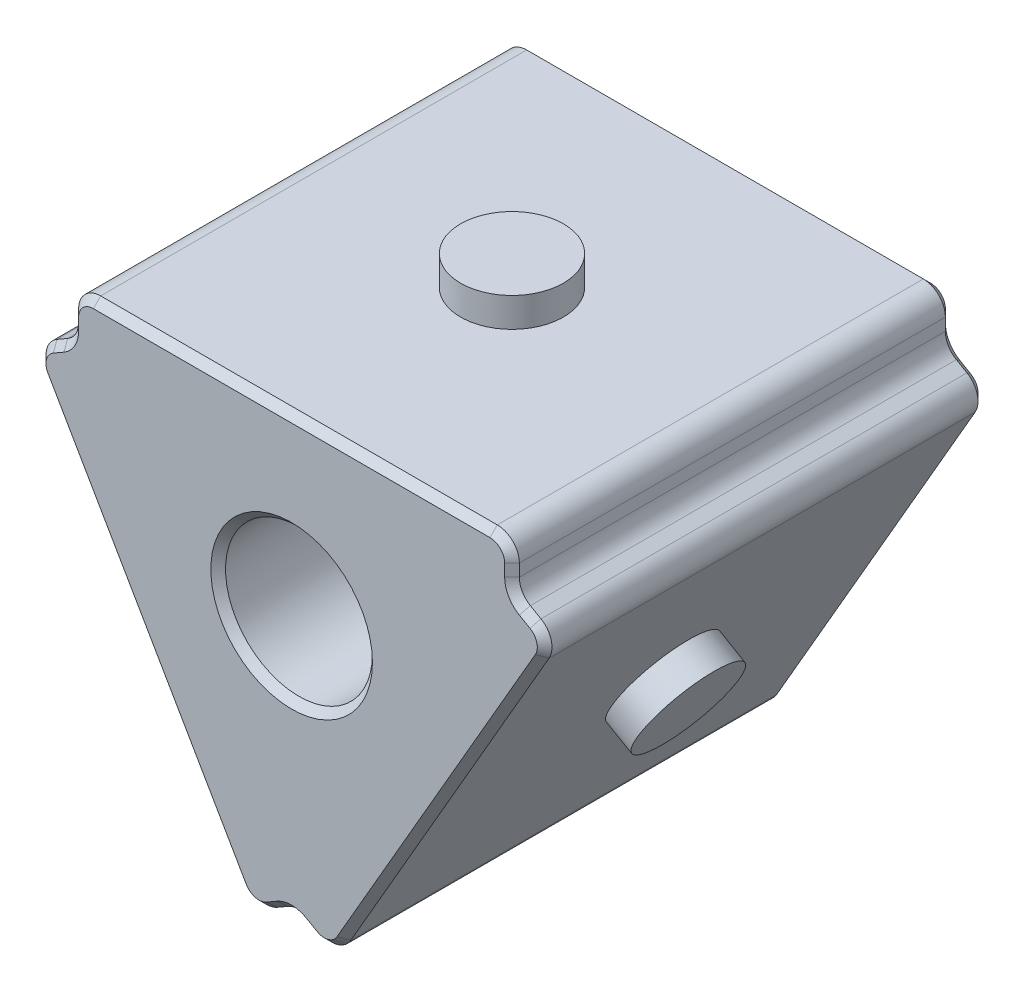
ISO-10303-21;
HEADER;
FILE_DESCRIPTION(('STEP AP214'),'2;1');
FILE_NAME('part.step','',(''),(''),'','','');
FILE_SCHEMA(('AUTOMOTIVE_DESIGN { 1 0 10303 214 1 1 1 1 }'));
ENDSEC;
DATA;
#1=APPLICATION_CONTEXT('core data for automotive mechanical design processes');
#2=APPLICATION_PROTOCOL_DEFINITION('international standard','automotive_design',2000,#1);
#3=PRODUCT_CONTEXT('',#1,'mechanical');
#4=PRODUCT('Part','Part','',(#3));
#5=PRODUCT_RELATED_PRODUCT_CATEGORY('part','',(#4));
#6=PRODUCT_DEFINITION_FORMATION('','',#4);
#7=PRODUCT_DEFINITION_CONTEXT('part definition',#1,'design');
#8=PRODUCT_DEFINITION('design','',#6,#7);
#9=PRODUCT_DEFINITION_SHAPE('','',#8);
#10=(LENGTH_UNIT() NAMED_UNIT(*) SI_UNIT(.MILLI.,.METRE.));
#11=(NAMED_UNIT(*) PLANE_ANGLE_UNIT() SI_UNIT($,.RADIAN.));
#12=(NAMED_UNIT(*) SI_UNIT($,.STERADIAN.) SOLID_ANGLE_UNIT());
#13=UNCERTAINTY_MEASURE_WITH_UNIT(LENGTH_MEASURE(1.E-05),#10,'distance_accuracy_value','');
#14=(GEOMETRIC_REPRESENTATION_CONTEXT(3) GLOBAL_UNCERTAINTY_ASSIGNED_CONTEXT((#13)) GLOBAL_UNIT_ASSIGNED_CONTEXT((#10,
#11,#12)) REPRESENTATION_CONTEXT('',''));
#15=CARTESIAN_POINT('',(0.,0.,0.));
#16=DIRECTION('',(0.,0.,1.));
#17=DIRECTION('',(1.,0.,0.));
#18=AXIS2_PLACEMENT_3D('',#15,#16,#17);
#19=CARTESIAN_POINT('',(0.,0.,30.));
#20=DIRECTION('',(0.,0.,1.));
#21=DIRECTION('',(1.,0.,0.));
#22=AXIS2_PLACEMENT_3D('',#19,#20,#21);
#23=PLANE('',#22);
#24=CARTESIAN_POINT('',(0.772793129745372,36.8565327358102,30.));
#25=DIRECTION('',(0.,0.,1.));
#26=DIRECTION('',(1.,0.,0.));
#27=AXIS2_PLACEMENT_3D('',#24,#25,#26);
#28=CIRCLE('',#27,5.50000000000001);
#29=CARTESIAN_POINT('',(6.27279312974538,36.8565327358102,30.));
#30=VERTEX_POINT('',#29);
#31=EDGE_CURVE('E417',#30,#30,#28,.F.);
#32=ORIENTED_EDGE('',*,*,#31,.T.);
#33=EDGE_LOOP('',(#32));
#34=FACE_BOUND('',#33,.T.);
#35=DIRECTION('',(0.,1.,0.));
#36=VECTOR('',#35,1.);
#37=CARTESIAN_POINT('',(15.2727931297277,47.2166700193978,30.));
#38=LINE('',#37,#36);
#39=CARTESIAN_POINT('',(15.2727931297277,46.3828121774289,30.));
#40=VERTEX_POINT('',#39);
#41=CARTESIAN_POINT('',(15.2727931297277,47.2166700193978,30.));
#42=VERTEX_POINT('',#41);
#43=EDGE_CURVE('E52',#40,#42,#38,.T.);
#44=ORIENTED_EDGE('',*,*,#43,.T.);
#45=CARTESIAN_POINT('',(14.2727931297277,47.2166700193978,30.));
#46=DIRECTION('',(0.,0.,1.));
#47=DIRECTION('',(1.,0.,0.));
#48=AXIS2_PLACEMENT_3D('',#45,#46,#47);
#49=CIRCLE('',#48,1.);
#50=CARTESIAN_POINT('',(14.2727931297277,48.2166700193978,30.));
#51=VERTEX_POINT('',#50);
#52=EDGE_CURVE('E415',#42,#51,#49,.T.);
#53=ORIENTED_EDGE('',*,*,#52,.T.);
#54=DIRECTION('',(-1.,0.,0.));
#55=VECTOR('',#54,1.);
#56=CARTESIAN_POINT('',(-12.727206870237,48.2166700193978,30.));
#57=LINE('',#56,#55);
#58=CARTESIAN_POINT('',(-12.727206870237,48.2166700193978,30.));
#59=VERTEX_POINT('',#58);
#60=EDGE_CURVE('E383',#51,#59,#57,.T.);
#61=ORIENTED_EDGE('',*,*,#60,.T.);
#62=CARTESIAN_POINT('',(-12.727206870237,47.2166700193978,30.));
#63=DIRECTION('',(0.,0.,1.));
#64=DIRECTION('',(1.,0.,0.));
#65=AXIS2_PLACEMENT_3D('',#62,#63,#64);
#66=CIRCLE('',#65,1.);
#67=CARTESIAN_POINT('',(-13.727206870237,47.2166700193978,30.));
#68=VERTEX_POINT('',#67);
#69=EDGE_CURVE('E385',#59,#68,#66,.T.);
#70=ORIENTED_EDGE('',*,*,#69,.T.);
#71=DIRECTION('',(0.,-1.,0.));
#72=VECTOR('',#71,1.);
#73=CARTESIAN_POINT('',(-13.727206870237,46.382812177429,30.));
#74=LINE('',#73,#72);
#75=CARTESIAN_POINT('',(-13.727206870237,46.382812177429,30.));
#76=VERTEX_POINT('',#75);
#77=EDGE_CURVE('E387',#68,#76,#74,.T.);
#78=ORIENTED_EDGE('',*,*,#77,.T.);
#79=CARTESIAN_POINT('',(-15.727206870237,46.3828121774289,30.));
#80=DIRECTION('',(0.,0.,1.));
#81=DIRECTION('',(1.,0.,0.));
#82=AXIS2_PLACEMENT_3D('',#79,#80,#81);
#83=CIRCLE('',#82,2.);
#84=CARTESIAN_POINT('',(-14.727206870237,44.6507613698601,30.));
#85=VERTEX_POINT('',#84);
#86=EDGE_CURVE('E389',#76,#85,#83,.F.);
#87=ORIENTED_EDGE('',*,*,#86,.T.);
#88=DIRECTION('',(-0.866025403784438,-0.500000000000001,0.));
#89=VECTOR('',#88,1.);
#90=CARTESIAN_POINT('',(-15.4493489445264,44.2338324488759,30.));
#91=LINE('',#90,#89);
#92=CARTESIAN_POINT('',(-15.4493489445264,44.2338324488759,30.));
#93=VERTEX_POINT('',#92);
#94=EDGE_CURVE('E391',#85,#93,#91,.T.);
#95=ORIENTED_EDGE('',*,*,#94,.T.);
#96=CARTESIAN_POINT('',(-14.9493489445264,43.3678070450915,30.));
#97=DIRECTION('',(0.,0.,1.));
#98=DIRECTION('',(1.,0.,0.));
#99=AXIS2_PLACEMENT_3D('',#96,#97,#98);
#100=CIRCLE('',#99,0.999999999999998);
#101=CARTESIAN_POINT('',(-15.8153743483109,42.8678070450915,30.));
#102=VERTEX_POINT('',#101);
#103=EDGE_CURVE('E393',#93,#102,#100,.T.);
#104=ORIENTED_EDGE('',*,*,#103,.T.);
#105=DIRECTION('',(0.500000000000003,-0.866025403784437,0.));
#106=VECTOR('',#105,1.);
#107=CARTESIAN_POINT('',(-2.31537434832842,19.4851211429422,30.));
#108=LINE('',#107,#106);
#109=CARTESIAN_POINT('',(-2.31537434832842,19.4851211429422,30.));
#110=VERTEX_POINT('',#109);
#111=EDGE_CURVE('E395',#102,#110,#108,.T.);
#112=ORIENTED_EDGE('',*,*,#111,.T.);
#113=CARTESIAN_POINT('',(-1.44934894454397,19.9851211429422,30.));
#114=DIRECTION('',(0.,0.,1.));
#115=DIRECTION('',(1.,0.,0.));
#116=AXIS2_PLACEMENT_3D('',#113,#114,#115);
#117=CIRCLE('',#116,1.);
#118=CARTESIAN_POINT('',(-0.949348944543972,19.1190957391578,30.));
#119=VERTEX_POINT('',#118);
#120=EDGE_CURVE('E397',#110,#119,#117,.T.);
#121=ORIENTED_EDGE('',*,*,#120,.T.);
#122=DIRECTION('',(0.866025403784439,0.5,0.));
#123=VECTOR('',#122,1.);
#124=CARTESIAN_POINT('',(-0.227206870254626,19.5360246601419,30.));
#125=LINE('',#124,#123);
#126=CARTESIAN_POINT('',(-0.227206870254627,19.5360246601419,30.));
#127=VERTEX_POINT('',#126);
#128=EDGE_CURVE('E399',#119,#127,#125,.T.);
#129=ORIENTED_EDGE('',*,*,#128,.T.);
#130=CARTESIAN_POINT('',(0.772793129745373,17.803973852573,30.));
#131=DIRECTION('',(0.,0.,1.));
#132=DIRECTION('',(1.,0.,0.));
#133=AXIS2_PLACEMENT_3D('',#130,#131,#132);
#134=CIRCLE('',#133,2.);
#135=CARTESIAN_POINT('',(1.77279312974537,19.5360246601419,30.));
#136=VERTEX_POINT('',#135);
#137=EDGE_CURVE('E401',#127,#136,#134,.F.);
#138=ORIENTED_EDGE('',*,*,#137,.T.);
#139=DIRECTION('',(0.866025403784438,-0.500000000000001,0.));
#140=VECTOR('',#139,1.);
#141=CARTESIAN_POINT('',(2.49493520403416,19.1190957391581,30.));
#142=LINE('',#141,#140);
#143=CARTESIAN_POINT('',(2.49493520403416,19.1190957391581,30.));
#144=VERTEX_POINT('',#143);
#145=EDGE_CURVE('E403',#136,#144,#142,.T.);
#146=ORIENTED_EDGE('',*,*,#145,.T.);
#147=CARTESIAN_POINT('',(2.99493520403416,19.9851211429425,30.));
#148=DIRECTION('',(0.,0.,1.));
#149=DIRECTION('',(1.,0.,0.));
#150=AXIS2_PLACEMENT_3D('',#147,#148,#149);
#151=CIRCLE('',#150,1.);
#152=CARTESIAN_POINT('',(3.8609606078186,19.4851211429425,30.));
#153=VERTEX_POINT('',#152);
#154=EDGE_CURVE('E405',#144,#153,#151,.T.);
#155=ORIENTED_EDGE('',*,*,#154,.T.);
#156=DIRECTION('',(0.5,0.866025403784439,0.));
#157=VECTOR('',#156,1.);
#158=CARTESIAN_POINT('',(17.3609606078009,42.8678070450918,30.));
#159=LINE('',#158,#157);
#160=CARTESIAN_POINT('',(17.3609606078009,42.8678070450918,30.));
#161=VERTEX_POINT('',#160);
#162=EDGE_CURVE('E407',#153,#161,#159,.T.);
#163=ORIENTED_EDGE('',*,*,#162,.T.);
#164=CARTESIAN_POINT('',(16.4949352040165,43.3678070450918,30.));
#165=DIRECTION('',(0.,0.,1.));
#166=DIRECTION('',(1.,0.,0.));
#167=AXIS2_PLACEMENT_3D('',#164,#165,#166);
#168=CIRCLE('',#167,0.999999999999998);
#169=CARTESIAN_POINT('',(16.9949352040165,44.2338324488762,30.));
#170=VERTEX_POINT('',#169);
#171=EDGE_CURVE('E409',#161,#170,#168,.T.);
#172=ORIENTED_EDGE('',*,*,#171,.T.);
#173=DIRECTION('',(-0.866025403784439,0.5,0.));
#174=VECTOR('',#173,1.);
#175=CARTESIAN_POINT('',(16.2727931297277,44.65076136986,30.));
#176=LINE('',#175,#174);
#177=CARTESIAN_POINT('',(16.2727931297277,44.65076136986,30.));
#178=VERTEX_POINT('',#177);
#179=EDGE_CURVE('E411',#170,#178,#176,.T.);
#180=ORIENTED_EDGE('',*,*,#179,.T.);
#181=CARTESIAN_POINT('',(17.2727931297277,46.3828121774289,30.));
#182=DIRECTION('',(0.,0.,1.));
#183=DIRECTION('',(1.,0.,0.));
#184=AXIS2_PLACEMENT_3D('',#181,#182,#183);
#185=CIRCLE('',#184,2.);
#186=EDGE_CURVE('E57',#178,#40,#185,.F.);
#187=ORIENTED_EDGE('',*,*,#186,.T.);
#188=EDGE_LOOP('',(#44,#53,#61,#70,#78,#87,#95,#104,#112,#121,#129,#138,#146,#155,#163,#172,
#180,#187));
#189=FACE_BOUND('',#188,.T.);
#190=ADVANCED_FACE('F36',(#34,#189),#23,.T.);
#191=CARTESIAN_POINT('',(0.,0.,0.));
#192=DIRECTION('',(0.,0.,1.));
#193=DIRECTION('',(1.,0.,0.));
#194=AXIS2_PLACEMENT_3D('',#191,#192,#193);
#195=PLANE('',#194);
#196=CARTESIAN_POINT('',(0.772793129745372,36.8565327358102,0.));
#197=DIRECTION('',(0.,0.,1.));
#198=DIRECTION('',(1.,0.,0.));
#199=AXIS2_PLACEMENT_3D('',#196,#197,#198);
#200=CIRCLE('',#199,5.5);
#201=CARTESIAN_POINT('',(6.27279312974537,36.8565327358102,0.));
#202=VERTEX_POINT('',#201);
#203=EDGE_CURVE('E297',#202,#202,#200,.T.);
#204=ORIENTED_EDGE('',*,*,#203,.T.);
#205=EDGE_LOOP('',(#204));
#206=FACE_BOUND('',#205,.T.);
#207=DIRECTION('',(0.866025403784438,0.500000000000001,0.));
#208=VECTOR('',#207,1.);
#209=CARTESIAN_POINT('',(-23.0161485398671,39.865138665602,0.));
#210=LINE('',#209,#208);
#211=CARTESIAN_POINT('',(-15.4493489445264,44.2338324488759,0.));
#212=VERTEX_POINT('',#211);
#213=CARTESIAN_POINT('',(-14.727206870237,44.6507613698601,0.));
#214=VERTEX_POINT('',#213);
#215=EDGE_CURVE('E295',#212,#214,#210,.T.);
#216=ORIENTED_EDGE('',*,*,#215,.T.);
#217=CARTESIAN_POINT('',(-15.727206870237,46.3828121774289,0.));
#218=DIRECTION('',(0.,0.,1.));
#219=DIRECTION('',(1.,0.,0.));
#220=AXIS2_PLACEMENT_3D('',#217,#218,#219);
#221=CIRCLE('',#220,1.99999999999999);
#222=CARTESIAN_POINT('',(-13.727206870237,46.382812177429,0.));
#223=VERTEX_POINT('',#222);
#224=EDGE_CURVE('E275',#214,#223,#221,.T.);
#225=ORIENTED_EDGE('',*,*,#224,.T.);
#226=DIRECTION('',(0.,1.,0.));
#227=VECTOR('',#226,1.);
#228=CARTESIAN_POINT('',(-13.7272068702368,0.,0.));
#229=LINE('',#228,#227);
#230=CARTESIAN_POINT('',(-13.727206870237,47.2166700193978,0.));
#231=VERTEX_POINT('',#230);
#232=EDGE_CURVE('E284',#223,#231,#229,.T.);
#233=ORIENTED_EDGE('',*,*,#232,.T.);
#234=CARTESIAN_POINT('',(-12.727206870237,47.2166700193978,0.));
#235=DIRECTION('',(0.,0.,1.));
#236=DIRECTION('',(1.,0.,0.));
#237=AXIS2_PLACEMENT_3D('',#234,#235,#236);
#238=CIRCLE('',#237,1.00000000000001);
#239=CARTESIAN_POINT('',(-12.727206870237,48.2166700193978,0.));
#240=VERTEX_POINT('',#239);
#241=EDGE_CURVE('E290',#231,#240,#238,.F.);
#242=ORIENTED_EDGE('',*,*,#241,.T.);
#243=DIRECTION('',(1.,0.,0.));
#244=VECTOR('',#243,1.);
#245=CARTESIAN_POINT('',(0.,48.2166700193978,0.));
#246=LINE('',#245,#244);
#247=CARTESIAN_POINT('',(14.2727931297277,48.2166700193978,0.));
#248=VERTEX_POINT('',#247);
#249=EDGE_CURVE('E580',#240,#248,#246,.T.);
#250=ORIENTED_EDGE('',*,*,#249,.T.);
#251=CARTESIAN_POINT('',(14.2727931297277,47.2166700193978,0.));
#252=DIRECTION('',(0.,0.,1.));
#253=DIRECTION('',(1.,0.,0.));
#254=AXIS2_PLACEMENT_3D('',#251,#252,#253);
#255=CIRCLE('',#254,1.00000000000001);
#256=CARTESIAN_POINT('',(15.2727931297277,47.2166700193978,0.));
#257=VERTEX_POINT('',#256);
#258=EDGE_CURVE('E578',#248,#257,#255,.F.);
#259=ORIENTED_EDGE('',*,*,#258,.T.);
#260=DIRECTION('',(0.,-1.,0.));
#261=VECTOR('',#260,1.);
#262=CARTESIAN_POINT('',(15.2727931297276,0.,0.));
#263=LINE('',#262,#261);
#264=CARTESIAN_POINT('',(15.2727931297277,46.3828121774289,0.));
#265=VERTEX_POINT('',#264);
#266=EDGE_CURVE('E576',#257,#265,#263,.T.);
#267=ORIENTED_EDGE('',*,*,#266,.T.);
#268=CARTESIAN_POINT('',(17.2727931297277,46.3828121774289,0.));
#269=DIRECTION('',(0.,0.,1.));
#270=DIRECTION('',(1.,0.,0.));
#271=AXIS2_PLACEMENT_3D('',#268,#269,#270);
#272=CIRCLE('',#271,1.99999999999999);
#273=CARTESIAN_POINT('',(16.2727931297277,44.65076136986,0.));
#274=VERTEX_POINT('',#273);
#275=EDGE_CURVE('E574',#265,#274,#272,.T.);
#276=ORIENTED_EDGE('',*,*,#275,.T.);
#277=DIRECTION('',(0.866025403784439,-0.5,0.));
#278=VECTOR('',#277,1.);
#279=CARTESIAN_POINT('',(23.4025451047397,40.5343971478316,0.));
#280=LINE('',#279,#278);
#281=CARTESIAN_POINT('',(16.9949352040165,44.2338324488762,0.));
#282=VERTEX_POINT('',#281);
#283=EDGE_CURVE('E572',#274,#282,#280,.T.);
#284=ORIENTED_EDGE('',*,*,#283,.T.);
#285=CARTESIAN_POINT('',(16.4949352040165,43.3678070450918,0.));
#286=DIRECTION('',(0.,0.,1.));
#287=DIRECTION('',(1.,0.,0.));
#288=AXIS2_PLACEMENT_3D('',#285,#286,#287);
#289=CIRCLE('',#288,1.00000000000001);
#290=CARTESIAN_POINT('',(17.360960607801,42.8678070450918,0.));
#291=VERTEX_POINT('',#290);
#292=EDGE_CURVE('E570',#282,#291,#289,.F.);
#293=ORIENTED_EDGE('',*,*,#292,.T.);
#294=DIRECTION('',(-0.5,-0.866025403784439,0.));
#295=VECTOR('',#294,1.);
#296=CARTESIAN_POINT('',(-5.5415844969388,3.19943530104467,0.));
#297=LINE('',#296,#295);
#298=CARTESIAN_POINT('',(3.8609606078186,19.4851211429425,0.));
#299=VERTEX_POINT('',#298);
#300=EDGE_CURVE('E568',#291,#299,#297,.T.);
#301=ORIENTED_EDGE('',*,*,#300,.T.);
#302=CARTESIAN_POINT('',(2.99493520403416,19.9851211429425,0.));
#303=DIRECTION('',(0.,0.,1.));
#304=DIRECTION('',(1.,0.,0.));
#305=AXIS2_PLACEMENT_3D('',#302,#303,#304);
#306=CIRCLE('',#305,1.00000000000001);
#307=CARTESIAN_POINT('',(2.49493520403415,19.1190957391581,0.));
#308=VERTEX_POINT('',#307);
#309=EDGE_CURVE('E566',#299,#308,#306,.F.);
#310=ORIENTED_EDGE('',*,*,#309,.T.);
#311=DIRECTION('',(-0.866025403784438,0.500000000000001,0.));
#312=VECTOR('',#311,1.);
#313=CARTESIAN_POINT('',(8.90254510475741,15.4196604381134,0.));
#314=LINE('',#313,#312);
#315=CARTESIAN_POINT('',(1.77279312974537,19.5360246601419,0.));
#316=VERTEX_POINT('',#315);
#317=EDGE_CURVE('E564',#308,#316,#314,.T.);
#318=ORIENTED_EDGE('',*,*,#317,.T.);
#319=CARTESIAN_POINT('',(0.772793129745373,17.803973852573,0.));
#320=DIRECTION('',(0.,0.,1.));
#321=DIRECTION('',(1.,0.,0.));
#322=AXIS2_PLACEMENT_3D('',#319,#320,#321);
#323=CIRCLE('',#322,1.99999999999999);
#324=CARTESIAN_POINT('',(-0.227206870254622,19.5360246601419,0.));
#325=VERTEX_POINT('',#324);
#326=EDGE_CURVE('E562',#316,#325,#323,.T.);
#327=ORIENTED_EDGE('',*,*,#326,.T.);
#328=DIRECTION('',(-0.866025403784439,-0.5,0.));
#329=VECTOR('',#328,1.);
#330=CARTESIAN_POINT('',(-8.51614853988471,14.7504019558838,0.));
#331=LINE('',#330,#329);
#332=CARTESIAN_POINT('',(-0.949348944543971,19.1190957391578,0.));
#333=VERTEX_POINT('',#332);
#334=EDGE_CURVE('E560',#325,#333,#331,.T.);
#335=ORIENTED_EDGE('',*,*,#334,.T.);
#336=CARTESIAN_POINT('',(-1.44934894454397,19.9851211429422,0.));
#337=DIRECTION('',(0.,0.,1.));
#338=DIRECTION('',(1.,0.,0.));
#339=AXIS2_PLACEMENT_3D('',#336,#337,#338);
#340=CIRCLE('',#339,1.00000000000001);
#341=CARTESIAN_POINT('',(-2.31537434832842,19.4851211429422,0.));
#342=VERTEX_POINT('',#341);
#343=EDGE_CURVE('E556',#333,#342,#340,.F.);
#344=ORIENTED_EDGE('',*,*,#343,.T.);
#345=DIRECTION('',(-0.500000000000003,0.866025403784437,0.));
#346=VECTOR('',#345,1.);
#347=CARTESIAN_POINT('',(6.70077419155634,3.86869378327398,0.));
#348=LINE('',#347,#346);
#349=CARTESIAN_POINT('',(-15.8153743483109,42.8678070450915,0.));
#350=VERTEX_POINT('',#349);
#351=EDGE_CURVE('E555',#342,#350,#348,.T.);
#352=ORIENTED_EDGE('',*,*,#351,.T.);
#353=CARTESIAN_POINT('',(-14.9493489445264,43.3678070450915,0.));
#354=DIRECTION('',(0.,0.,1.));
#355=DIRECTION('',(1.,0.,0.));
#356=AXIS2_PLACEMENT_3D('',#353,#354,#355);
#357=CIRCLE('',#356,1.00000000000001);
#358=EDGE_CURVE('E302',#350,#212,#357,.F.);
#359=ORIENTED_EDGE('',*,*,#358,.T.);
#360=EDGE_LOOP('',(#216,#225,#233,#242,#250,#259,#267,#276,#284,#293,#301,#310,#318,#327,#335,
#344,#352,#359));
#361=FACE_BOUND('',#360,.T.);
#362=ADVANCED_FACE('F293',(#206,#361),#195,.F.);
#363=CARTESIAN_POINT('',(-14.227206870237,45.5167867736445,30.));
#364=DIRECTION('',(1.,0.,0.));
#365=DIRECTION('',(0.,1.,0.));
#366=AXIS2_PLACEMENT_3D('',#363,#364,#365);
#367=PLANE('',#366);
#368=DIRECTION('',(0.,0.,-1.));
#369=VECTOR('',#368,1.);
#370=CARTESIAN_POINT('',(-14.227206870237,47.2166700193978,30.));
#371=LINE('',#370,#369);
#372=CARTESIAN_POINT('',(-14.227206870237,47.2166700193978,29.5));
#373=VERTEX_POINT('',#372);
#374=CARTESIAN_POINT('',(-14.227206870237,47.2166700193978,0.5));
#375=VERTEX_POINT('',#374);
#376=EDGE_CURVE('E597',#373,#375,#371,.T.);
#377=ORIENTED_EDGE('',*,*,#376,.T.);
#378=DIRECTION('',(0.,-1.,0.));
#379=VECTOR('',#378,1.);
#380=CARTESIAN_POINT('',(-14.227206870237,45.5167867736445,0.5));
#381=LINE('',#380,#379);
#382=CARTESIAN_POINT('',(-14.227206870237,46.382812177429,0.5));
#383=VERTEX_POINT('',#382);
#384=EDGE_CURVE('E381',#375,#383,#381,.T.);
#385=ORIENTED_EDGE('',*,*,#384,.T.);
#386=DIRECTION('',(0.,0.,-1.));
#387=VECTOR('',#386,1.);
#388=CARTESIAN_POINT('',(-14.227206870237,46.382812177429,30.));
#389=LINE('',#388,#387);
#390=CARTESIAN_POINT('',(-14.227206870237,46.382812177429,29.5));
#391=VERTEX_POINT('',#390);
#392=EDGE_CURVE('E594',#383,#391,#389,.F.);
#393=ORIENTED_EDGE('',*,*,#392,.T.);
#394=DIRECTION('',(0.,1.,0.));
#395=VECTOR('',#394,1.);
#396=CARTESIAN_POINT('',(-14.227206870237,47.2166700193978,29.5));
#397=LINE('',#396,#395);
#398=EDGE_CURVE('E379',#391,#373,#397,.T.);
#399=ORIENTED_EDGE('',*,*,#398,.T.);
#400=EDGE_LOOP('',(#377,#385,#393,#399));
#401=FACE_BOUND('',#400,.T.);
#402=ADVANCED_FACE('F801',(#401),#367,.F.);
#403=CARTESIAN_POINT('',(-16.9983870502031,43.9168451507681,30.));
#404=DIRECTION('',(0.500000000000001,-0.866025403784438,0.));
#405=DIRECTION('',(0.866025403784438,0.500000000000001,0.));
#406=AXIS2_PLACEMENT_3D('',#403,#404,#405);
#407=PLANE('',#406);
#408=DIRECTION('',(0.,0.,-1.));
#409=VECTOR('',#408,1.);
#410=CARTESIAN_POINT('',(-14.977206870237,45.0837740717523,0.));
#411=LINE('',#410,#409);
#412=CARTESIAN_POINT('',(-14.977206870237,45.0837740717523,29.5));
#413=VERTEX_POINT('',#412);
#414=CARTESIAN_POINT('',(-14.977206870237,45.0837740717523,0.500000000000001));
#415=VERTEX_POINT('',#414);
#416=EDGE_CURVE('E600',#413,#415,#411,.T.);
#417=ORIENTED_EDGE('',*,*,#416,.T.);
#418=DIRECTION('',(-0.866025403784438,-0.500000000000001,0.));
#419=VECTOR('',#418,1.);
#420=CARTESIAN_POINT('',(-16.9983870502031,43.9168451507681,0.5));
#421=LINE('',#420,#419);
#422=CARTESIAN_POINT('',(-15.6993489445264,44.6668451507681,0.5));
#423=VERTEX_POINT('',#422);
#424=EDGE_CURVE('E316',#415,#423,#421,.T.);
#425=ORIENTED_EDGE('',*,*,#424,.T.);
#426=DIRECTION('',(0.,0.,-1.));
#427=VECTOR('',#426,1.);
#428=CARTESIAN_POINT('',(-15.6993489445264,44.6668451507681,30.));
#429=LINE('',#428,#427);
#430=CARTESIAN_POINT('',(-15.6993489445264,44.6668451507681,29.5));
#431=VERTEX_POINT('',#430);
#432=EDGE_CURVE('E603',#423,#431,#429,.F.);
#433=ORIENTED_EDGE('',*,*,#432,.T.);
#434=DIRECTION('',(0.866025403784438,0.500000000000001,0.));
#435=VECTOR('',#434,1.);
#436=CARTESIAN_POINT('',(-14.977206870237,45.0837740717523,29.5));
#437=LINE('',#436,#435);
#438=EDGE_CURVE('E314',#431,#413,#437,.T.);
#439=ORIENTED_EDGE('',*,*,#438,.T.);
#440=EDGE_LOOP('',(#417,#425,#433,#439));
#441=FACE_BOUND('',#440,.T.);
#442=ADVANCED_FACE('F531',(#441),#407,.F.);
#443=CARTESIAN_POINT('',(-16.9983870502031,43.9168451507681,30.));
#444=DIRECTION('',(0.866025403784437,0.500000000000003,0.));
#445=DIRECTION('',(-0.500000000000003,0.866025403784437,0.));
#446=AXIS2_PLACEMENT_3D('',#443,#444,#445);
#447=PLANE('',#446);
#448=CARTESIAN_POINT('',(-9.49838705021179,30.9264640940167,15.));
#449=DIRECTION('',(0.866025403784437,0.500000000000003,0.));
#450=DIRECTION('',(-0.500000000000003,0.866025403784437,0.));
#451=AXIS2_PLACEMENT_3D('',#448,#449,#450);
#452=CIRCLE('',#451,3.5);
#453=CARTESIAN_POINT('',(-11.2483870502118,33.9575530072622,15.));
#454=VERTEX_POINT('',#453);
#455=EDGE_CURVE('E45',#454,#454,#452,.F.);
#456=ORIENTED_EDGE('',*,*,#455,.F.);
#457=EDGE_LOOP('',(#456));
#458=FACE_BOUND('',#457,.T.);
#459=DIRECTION('',(0.,0.,-1.));
#460=VECTOR('',#459,1.);
#461=CARTESIAN_POINT('',(-16.2483870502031,42.6178070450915,30.));
#462=LINE('',#461,#460);
#463=CARTESIAN_POINT('',(-16.2483870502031,42.6178070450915,29.5));
#464=VERTEX_POINT('',#463);
#465=CARTESIAN_POINT('',(-16.2483870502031,42.6178070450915,0.5));
#466=VERTEX_POINT('',#465);
#467=EDGE_CURVE('E535',#464,#466,#462,.T.);
#468=ORIENTED_EDGE('',*,*,#467,.T.);
#469=DIRECTION('',(0.500000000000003,-0.866025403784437,0.));
#470=VECTOR('',#469,1.);
#471=CARTESIAN_POINT('',(-16.9983870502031,43.9168451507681,0.5));
#472=LINE('',#471,#470);
#473=CARTESIAN_POINT('',(-2.74838705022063,19.2351211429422,0.5));
#474=VERTEX_POINT('',#473);
#475=EDGE_CURVE('E324',#466,#474,#472,.T.);
#476=ORIENTED_EDGE('',*,*,#475,.T.);
#477=DIRECTION('',(0.,0.,-1.));
#478=VECTOR('',#477,1.);
#479=CARTESIAN_POINT('',(-2.74838705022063,19.2351211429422,30.));
#480=LINE('',#479,#478);
#481=CARTESIAN_POINT('',(-2.74838705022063,19.2351211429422,29.5));
#482=VERTEX_POINT('',#481);
#483=EDGE_CURVE('E543',#474,#482,#480,.F.);
#484=ORIENTED_EDGE('',*,*,#483,.T.);
#485=DIRECTION('',(-0.500000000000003,0.866025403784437,0.));
#486=VECTOR('',#485,1.);
#487=CARTESIAN_POINT('',(-16.2483870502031,42.6178070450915,29.5));
#488=LINE('',#487,#486);
#489=EDGE_CURVE('E322',#482,#464,#488,.T.);
#490=ORIENTED_EDGE('',*,*,#489,.T.);
#491=EDGE_LOOP('',(#468,#476,#484,#490));
#492=FACE_BOUND('',#491,.T.);
#493=ADVANCED_FACE('F527',(#458,#492),#447,.F.);
#494=CARTESIAN_POINT('',(0.772793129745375,19.5360246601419,30.));
#495=DIRECTION('',(-0.499999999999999,0.866025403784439,0.));
#496=DIRECTION('',(-0.866025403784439,-0.5,0.));
#497=AXIS2_PLACEMENT_3D('',#494,#495,#496);
#498=PLANE('',#497);
#499=DIRECTION('',(0.,0.,-1.));
#500=VECTOR('',#499,1.);
#501=CARTESIAN_POINT('',(-0.699348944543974,18.6860830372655,30.));
#502=LINE('',#501,#500);
#503=CARTESIAN_POINT('',(-0.699348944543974,18.6860830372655,29.5));
#504=VERTEX_POINT('',#503);
#505=CARTESIAN_POINT('',(-0.699348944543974,18.6860830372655,0.5));
#506=VERTEX_POINT('',#505);
#507=EDGE_CURVE('E609',#504,#506,#502,.T.);
#508=ORIENTED_EDGE('',*,*,#507,.T.);
#509=DIRECTION('',(0.866025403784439,0.5,0.));
#510=VECTOR('',#509,1.);
#511=CARTESIAN_POINT('',(0.772793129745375,19.5360246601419,0.5));
#512=LINE('',#511,#510);
#513=CARTESIAN_POINT('',(0.0227931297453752,19.1030119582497,0.5));
#514=VERTEX_POINT('',#513);
#515=EDGE_CURVE('E332',#506,#514,#512,.T.);
#516=ORIENTED_EDGE('',*,*,#515,.T.);
#517=DIRECTION('',(0.,0.,-1.));
#518=VECTOR('',#517,1.);
#519=CARTESIAN_POINT('',(0.0227931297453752,19.1030119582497,30.));
#520=LINE('',#519,#518);
#521=CARTESIAN_POINT('',(0.0227931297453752,19.1030119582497,29.5));
#522=VERTEX_POINT('',#521);
#523=EDGE_CURVE('E606',#514,#522,#520,.F.);
#524=ORIENTED_EDGE('',*,*,#523,.T.);
#525=DIRECTION('',(-0.866025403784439,-0.5,0.));
#526=VECTOR('',#525,1.);
#527=CARTESIAN_POINT('',(-0.699348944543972,18.6860830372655,29.5));
#528=LINE('',#527,#526);
#529=EDGE_CURVE('E330',#522,#504,#528,.T.);
#530=ORIENTED_EDGE('',*,*,#529,.T.);
#531=EDGE_LOOP('',(#508,#516,#524,#530));
#532=FACE_BOUND('',#531,.T.);
#533=ADVANCED_FACE('F530',(#532),#498,.F.);
#534=CARTESIAN_POINT('',(3.54397330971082,17.9360830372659,30.));
#535=DIRECTION('',(0.500000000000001,0.866025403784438,0.));
#536=DIRECTION('',(-0.866025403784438,0.500000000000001,0.));
#537=AXIS2_PLACEMENT_3D('',#534,#535,#536);
#538=PLANE('',#537);
#539=DIRECTION('',(0.,0.,-1.));
#540=VECTOR('',#539,1.);
#541=CARTESIAN_POINT('',(1.52279312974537,19.1030119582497,0.));
#542=LINE('',#541,#540);
#543=CARTESIAN_POINT('',(1.52279312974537,19.1030119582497,29.5));
#544=VERTEX_POINT('',#543);
#545=CARTESIAN_POINT('',(1.52279312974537,19.1030119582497,0.5));
#546=VERTEX_POINT('',#545);
#547=EDGE_CURVE('E612',#544,#546,#542,.T.);
#548=ORIENTED_EDGE('',*,*,#547,.T.);
#549=DIRECTION('',(0.866025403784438,-0.500000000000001,0.));
#550=VECTOR('',#549,1.);
#551=CARTESIAN_POINT('',(3.54397330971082,17.9360830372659,0.5));
#552=LINE('',#551,#550);
#553=CARTESIAN_POINT('',(2.24493520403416,18.6860830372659,0.5));
#554=VERTEX_POINT('',#553);
#555=EDGE_CURVE('E340',#546,#554,#552,.T.);
#556=ORIENTED_EDGE('',*,*,#555,.T.);
#557=DIRECTION('',(0.,0.,-1.));
#558=VECTOR('',#557,1.);
#559=CARTESIAN_POINT('',(2.24493520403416,18.6860830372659,30.));
#560=LINE('',#559,#558);
#561=CARTESIAN_POINT('',(2.24493520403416,18.6860830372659,29.5));
#562=VERTEX_POINT('',#561);
#563=EDGE_CURVE('E615',#554,#562,#560,.F.);
#564=ORIENTED_EDGE('',*,*,#563,.T.);
#565=DIRECTION('',(-0.866025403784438,0.500000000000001,0.));
#566=VECTOR('',#565,1.);
#567=CARTESIAN_POINT('',(1.52279312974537,19.1030119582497,29.5));
#568=LINE('',#567,#566);
#569=EDGE_CURVE('E338',#562,#544,#568,.T.);
#570=ORIENTED_EDGE('',*,*,#569,.T.);
#571=EDGE_LOOP('',(#548,#556,#564,#570));
#572=FACE_BOUND('',#571,.T.);
#573=ADVANCED_FACE('F651',(#572),#538,.F.);
#574=CARTESIAN_POINT('',(3.54397330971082,17.9360830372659,30.));
#575=DIRECTION('',(-0.866025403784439,0.5,0.));
#576=DIRECTION('',(-0.5,-0.866025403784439,0.));
#577=AXIS2_PLACEMENT_3D('',#574,#575,#576);
#578=PLANE('',#577);
#579=CARTESIAN_POINT('',(11.043973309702,30.9264640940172,15.));
#580=DIRECTION('',(-0.866025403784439,0.5,0.));
#581=DIRECTION('',(-0.5,-0.866025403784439,0.));
#582=AXIS2_PLACEMENT_3D('',#579,#580,#581);
#583=CIRCLE('',#582,3.5);
#584=CARTESIAN_POINT('',(9.29397330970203,27.8953751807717,15.));
#585=VERTEX_POINT('',#584);
#586=EDGE_CURVE('E11',#585,#585,#583,.F.);
#587=ORIENTED_EDGE('',*,*,#586,.F.);
#588=EDGE_LOOP('',(#587));
#589=FACE_BOUND('',#588,.T.);
#590=DIRECTION('',(0.,0.,-1.));
#591=VECTOR('',#590,1.);
#592=CARTESIAN_POINT('',(4.29397330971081,19.2351211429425,30.));
#593=LINE('',#592,#591);
#594=CARTESIAN_POINT('',(4.29397330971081,19.2351211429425,29.5));
#595=VERTEX_POINT('',#594);
#596=CARTESIAN_POINT('',(4.29397330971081,19.2351211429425,0.5));
#597=VERTEX_POINT('',#596);
#598=EDGE_CURVE('E291',#595,#597,#593,.T.);
#599=ORIENTED_EDGE('',*,*,#598,.T.);
#600=DIRECTION('',(0.5,0.866025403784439,0.));
#601=VECTOR('',#600,1.);
#602=CARTESIAN_POINT('',(3.54397330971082,17.9360830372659,0.5));
#603=LINE('',#602,#601);
#604=CARTESIAN_POINT('',(17.7939733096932,42.6178070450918,0.5));
#605=VERTEX_POINT('',#604);
#606=EDGE_CURVE('E348',#597,#605,#603,.T.);
#607=ORIENTED_EDGE('',*,*,#606,.T.);
#608=DIRECTION('',(0.,0.,-1.));
#609=VECTOR('',#608,1.);
#610=CARTESIAN_POINT('',(17.7939733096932,42.6178070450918,30.));
#611=LINE('',#610,#609);
#612=CARTESIAN_POINT('',(17.7939733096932,42.6178070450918,29.5));
#613=VERTEX_POINT('',#612);
#614=EDGE_CURVE('E542',#605,#613,#611,.F.);
#615=ORIENTED_EDGE('',*,*,#614,.T.);
#616=DIRECTION('',(-0.5,-0.866025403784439,0.));
#617=VECTOR('',#616,1.);
#618=CARTESIAN_POINT('',(4.29397330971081,19.2351211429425,29.5));
#619=LINE('',#618,#617);
#620=EDGE_CURVE('E346',#613,#595,#619,.T.);
#621=ORIENTED_EDGE('',*,*,#620,.T.);
#622=EDGE_LOOP('',(#599,#607,#615,#621));
#623=FACE_BOUND('',#622,.T.);
#624=ADVANCED_FACE('F647',(#589,#623),#578,.F.);
#625=CARTESIAN_POINT('',(15.7727931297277,45.5167867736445,30.));
#626=DIRECTION('',(-0.5,-0.866025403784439,0.));
#627=DIRECTION('',(0.866025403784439,-0.5,0.));
#628=AXIS2_PLACEMENT_3D('',#625,#626,#627);
#629=PLANE('',#628);
#630=DIRECTION('',(0.,0.,-1.));
#631=VECTOR('',#630,1.);
#632=CARTESIAN_POINT('',(17.2449352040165,44.6668451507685,30.));
#633=LINE('',#632,#631);
#634=CARTESIAN_POINT('',(17.2449352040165,44.6668451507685,29.5));
#635=VERTEX_POINT('',#634);
#636=CARTESIAN_POINT('',(17.2449352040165,44.6668451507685,0.5));
#637=VERTEX_POINT('',#636);
#638=EDGE_CURVE('E621',#635,#637,#633,.T.);
#639=ORIENTED_EDGE('',*,*,#638,.T.);
#640=DIRECTION('',(-0.866025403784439,0.5,0.));
#641=VECTOR('',#640,1.);
#642=CARTESIAN_POINT('',(15.7727931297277,45.5167867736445,0.5));
#643=LINE('',#642,#641);
#644=CARTESIAN_POINT('',(16.5227931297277,45.0837740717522,0.5));
#645=VERTEX_POINT('',#644);
#646=EDGE_CURVE('E356',#637,#645,#643,.T.);
#647=ORIENTED_EDGE('',*,*,#646,.T.);
#648=DIRECTION('',(0.,0.,-1.));
#649=VECTOR('',#648,1.);
#650=CARTESIAN_POINT('',(16.5227931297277,45.0837740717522,30.));
#651=LINE('',#650,#649);
#652=CARTESIAN_POINT('',(16.5227931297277,45.0837740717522,29.5));
#653=VERTEX_POINT('',#652);
#654=EDGE_CURVE('E618',#645,#653,#651,.F.);
#655=ORIENTED_EDGE('',*,*,#654,.T.);
#656=DIRECTION('',(0.866025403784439,-0.5,0.));
#657=VECTOR('',#656,1.);
#658=CARTESIAN_POINT('',(17.2449352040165,44.6668451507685,29.5));
#659=LINE('',#658,#657);
#660=EDGE_CURVE('E354',#653,#635,#659,.T.);
#661=ORIENTED_EDGE('',*,*,#660,.T.);
#662=EDGE_LOOP('',(#639,#647,#655,#661));
#663=FACE_BOUND('',#662,.T.);
#664=ADVANCED_FACE('F650',(#663),#629,.F.);
#665=CARTESIAN_POINT('',(15.7727931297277,48.7166700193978,30.));
#666=DIRECTION('',(-1.,0.,0.));
#667=DIRECTION('',(0.,-1.,0.));
#668=AXIS2_PLACEMENT_3D('',#665,#666,#667);
#669=PLANE('',#668);
#670=DIRECTION('',(0.,0.,-1.));
#671=VECTOR('',#670,1.);
#672=CARTESIAN_POINT('',(15.7727931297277,46.3828121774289,0.));
#673=LINE('',#672,#671);
#674=CARTESIAN_POINT('',(15.7727931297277,46.3828121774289,29.5));
#675=VERTEX_POINT('',#674);
#676=CARTESIAN_POINT('',(15.7727931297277,46.3828121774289,0.500000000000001));
#677=VERTEX_POINT('',#676);
#678=EDGE_CURVE('E624',#675,#677,#673,.T.);
#679=ORIENTED_EDGE('',*,*,#678,.T.);
#680=DIRECTION('',(0.,1.,0.));
#681=VECTOR('',#680,1.);
#682=CARTESIAN_POINT('',(15.7727931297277,48.7166700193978,0.5));
#683=LINE('',#682,#681);
#684=CARTESIAN_POINT('',(15.7727931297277,47.2166700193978,0.5));
#685=VERTEX_POINT('',#684);
#686=EDGE_CURVE('E364',#677,#685,#683,.T.);
#687=ORIENTED_EDGE('',*,*,#686,.T.);
#688=DIRECTION('',(0.,0.,-1.));
#689=VECTOR('',#688,1.);
#690=CARTESIAN_POINT('',(15.7727931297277,47.2166700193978,30.));
#691=LINE('',#690,#689);
#692=CARTESIAN_POINT('',(15.7727931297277,47.2166700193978,29.5));
#693=VERTEX_POINT('',#692);
#694=EDGE_CURVE('E468',#685,#693,#691,.F.);
#695=ORIENTED_EDGE('',*,*,#694,.T.);
#696=DIRECTION('',(0.,-1.,0.));
#697=VECTOR('',#696,1.);
#698=CARTESIAN_POINT('',(15.7727931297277,46.3828121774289,29.5));
#699=LINE('',#698,#697);
#700=EDGE_CURVE('E362',#693,#675,#699,.T.);
#701=ORIENTED_EDGE('',*,*,#700,.T.);
#702=EDGE_LOOP('',(#679,#687,#695,#701));
#703=FACE_BOUND('',#702,.T.);
#704=ADVANCED_FACE('F810',(#703),#669,.F.);
#705=CARTESIAN_POINT('',(15.7727931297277,48.7166700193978,30.));
#706=DIRECTION('',(0.,-1.,0.));
#707=DIRECTION('',(0.,0.,-1.));
#708=AXIS2_PLACEMENT_3D('',#705,#706,#707);
#709=PLANE('',#708);
#710=CARTESIAN_POINT('',(0.772793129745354,48.7166700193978,15.));
#711=DIRECTION('',(0.,-1.,0.));
#712=DIRECTION('',(0.,0.,-1.));
#713=AXIS2_PLACEMENT_3D('',#710,#711,#712);
#714=CIRCLE('',#713,3.5);
#715=CARTESIAN_POINT('',(0.772793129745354,48.7166700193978,11.5));
#716=VERTEX_POINT('',#715);
#717=EDGE_CURVE('E419',#716,#716,#714,.F.);
#718=ORIENTED_EDGE('',*,*,#717,.F.);
#719=EDGE_LOOP('',(#718));
#720=FACE_BOUND('',#719,.T.);
#721=DIRECTION('',(0.,0.,-1.));
#722=VECTOR('',#721,1.);
#723=CARTESIAN_POINT('',(14.2727931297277,48.7166700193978,30.));
#724=LINE('',#723,#722);
#725=CARTESIAN_POINT('',(14.2727931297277,48.7166700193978,29.5));
#726=VERTEX_POINT('',#725);
#727=CARTESIAN_POINT('',(14.2727931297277,48.7166700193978,0.5));
#728=VERTEX_POINT('',#727);
#729=EDGE_CURVE('E591',#726,#728,#724,.T.);
#730=ORIENTED_EDGE('',*,*,#729,.T.);
#731=DIRECTION('',(-1.,0.,0.));
#732=VECTOR('',#731,1.);
#733=CARTESIAN_POINT('',(15.7727931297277,48.7166700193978,0.5));
#734=LINE('',#733,#732);
#735=CARTESIAN_POINT('',(-12.727206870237,48.7166700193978,0.5));
#736=VERTEX_POINT('',#735);
#737=EDGE_CURVE('E373',#728,#736,#734,.T.);
#738=ORIENTED_EDGE('',*,*,#737,.T.);
#739=DIRECTION('',(0.,0.,-1.));
#740=VECTOR('',#739,1.);
#741=CARTESIAN_POINT('',(-12.727206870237,48.7166700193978,30.));
#742=LINE('',#741,#740);
#743=CARTESIAN_POINT('',(-12.727206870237,48.7166700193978,29.5));
#744=VERTEX_POINT('',#743);
#745=EDGE_CURVE('E588',#736,#744,#742,.F.);
#746=ORIENTED_EDGE('',*,*,#745,.T.);
#747=DIRECTION('',(1.,0.,0.));
#748=VECTOR('',#747,1.);
#749=CARTESIAN_POINT('',(14.2727931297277,48.7166700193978,29.5));
#750=LINE('',#749,#748);
#751=EDGE_CURVE('E371',#744,#726,#750,.T.);
#752=ORIENTED_EDGE('',*,*,#751,.T.);
#753=EDGE_LOOP('',(#730,#738,#746,#752));
#754=FACE_BOUND('',#753,.T.);
#755=ADVANCED_FACE('F713',(#720,#754),#709,.F.);
#756=CARTESIAN_POINT('',(0.772793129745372,36.8565327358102,30.));
#757=DIRECTION('',(0.,0.,-1.));
#758=DIRECTION('',(-1.,0.,0.));
#759=AXIS2_PLACEMENT_3D('',#756,#757,#758);
#760=CYLINDRICAL_SURFACE('',#759,5.);
#761=CARTESIAN_POINT('',(0.772793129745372,36.8565327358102,0.499999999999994));
#762=DIRECTION('',(0.,0.,1.));
#763=DIRECTION('',(1.,0.,0.));
#764=AXIS2_PLACEMENT_3D('',#761,#762,#763);
#765=CIRCLE('',#764,5.);
#766=CARTESIAN_POINT('',(5.77279312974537,36.8565327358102,0.499999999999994));
#767=VERTEX_POINT('',#766);
#768=EDGE_CURVE('E308',#767,#767,#765,.F.);
#769=ORIENTED_EDGE('',*,*,#768,.T.);
#770=EDGE_LOOP('',(#769));
#771=FACE_BOUND('',#770,.T.);
#772=CARTESIAN_POINT('',(0.772793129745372,36.8565327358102,29.5));
#773=DIRECTION('',(0.,0.,1.));
#774=DIRECTION('',(1.,0.,0.));
#775=AXIS2_PLACEMENT_3D('',#772,#773,#774);
#776=CIRCLE('',#775,5.);
#777=CARTESIAN_POINT('',(5.77279312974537,36.8565327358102,29.5));
#778=VERTEX_POINT('',#777);
#779=EDGE_CURVE('E300',#778,#778,#776,.T.);
#780=ORIENTED_EDGE('',*,*,#779,.T.);
#781=EDGE_LOOP('',(#780));
#782=FACE_BOUND('',#781,.T.);
#783=ADVANCED_FACE('F805',(#771,#782),#760,.F.);
#784=CARTESIAN_POINT('',(17.2727931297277,46.3828121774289,30.));
#785=DIRECTION('',(0.,0.,1.));
#786=DIRECTION('',(1.,0.,0.));
#787=AXIS2_PLACEMENT_3D('',#784,#785,#786);
#788=CYLINDRICAL_SURFACE('',#787,1.5);
#789=ORIENTED_EDGE('',*,*,#654,.F.);
#790=CARTESIAN_POINT('',(17.2727931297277,46.3828121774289,0.5));
#791=DIRECTION('',(0.,0.,1.));
#792=DIRECTION('',(1.,0.,0.));
#793=AXIS2_PLACEMENT_3D('',#790,#791,#792);
#794=CIRCLE('',#793,1.5);
#795=EDGE_CURVE('E360',#645,#677,#794,.F.);
#796=ORIENTED_EDGE('',*,*,#795,.T.);
#797=ORIENTED_EDGE('',*,*,#678,.F.);
#798=CARTESIAN_POINT('',(17.2727931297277,46.3828121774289,29.5));
#799=DIRECTION('',(0.,0.,1.));
#800=DIRECTION('',(1.,0.,0.));
#801=AXIS2_PLACEMENT_3D('',#798,#799,#800);
#802=CIRCLE('',#801,1.5);
#803=EDGE_CURVE('E358',#675,#653,#802,.T.);
#804=ORIENTED_EDGE('',*,*,#803,.T.);
#805=EDGE_LOOP('',(#789,#796,#797,#804));
#806=FACE_BOUND('',#805,.T.);
#807=ADVANCED_FACE('F828',(#806),#788,.F.);
#808=CARTESIAN_POINT('',(0.772793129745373,17.803973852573,30.));
#809=DIRECTION('',(0.,0.,1.));
#810=DIRECTION('',(1.,0.,0.));
#811=AXIS2_PLACEMENT_3D('',#808,#809,#810);
#812=CYLINDRICAL_SURFACE('',#811,1.5);
#813=ORIENTED_EDGE('',*,*,#523,.F.);
#814=CARTESIAN_POINT('',(0.772793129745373,17.803973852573,0.5));
#815=DIRECTION('',(0.,0.,1.));
#816=DIRECTION('',(1.,0.,0.));
#817=AXIS2_PLACEMENT_3D('',#814,#815,#816);
#818=CIRCLE('',#817,1.5);
#819=EDGE_CURVE('E336',#514,#546,#818,.F.);
#820=ORIENTED_EDGE('',*,*,#819,.T.);
#821=ORIENTED_EDGE('',*,*,#547,.F.);
#822=CARTESIAN_POINT('',(0.772793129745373,17.803973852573,29.5));
#823=DIRECTION('',(0.,0.,1.));
#824=DIRECTION('',(1.,0.,0.));
#825=AXIS2_PLACEMENT_3D('',#822,#823,#824);
#826=CIRCLE('',#825,1.5);
#827=EDGE_CURVE('E334',#544,#522,#826,.T.);
#828=ORIENTED_EDGE('',*,*,#827,.T.);
#829=EDGE_LOOP('',(#813,#820,#821,#828));
#830=FACE_BOUND('',#829,.T.);
#831=ADVANCED_FACE('F831',(#830),#812,.F.);
#832=CARTESIAN_POINT('',(-15.727206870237,46.3828121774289,30.));
#833=DIRECTION('',(0.,0.,1.));
#834=DIRECTION('',(1.,0.,0.));
#835=AXIS2_PLACEMENT_3D('',#832,#833,#834);
#836=CYLINDRICAL_SURFACE('',#835,1.5);
#837=ORIENTED_EDGE('',*,*,#392,.F.);
#838=CARTESIAN_POINT('',(-15.727206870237,46.3828121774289,0.5));
#839=DIRECTION('',(0.,0.,1.));
#840=DIRECTION('',(1.,0.,0.));
#841=AXIS2_PLACEMENT_3D('',#838,#839,#840);
#842=CIRCLE('',#841,1.5);
#843=EDGE_CURVE('E277',#383,#415,#842,.F.);
#844=ORIENTED_EDGE('',*,*,#843,.T.);
#845=ORIENTED_EDGE('',*,*,#416,.F.);
#846=CARTESIAN_POINT('',(-15.727206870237,46.3828121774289,29.5));
#847=DIRECTION('',(0.,0.,1.));
#848=DIRECTION('',(1.,0.,0.));
#849=AXIS2_PLACEMENT_3D('',#846,#847,#848);
#850=CIRCLE('',#849,1.5);
#851=EDGE_CURVE('E311',#413,#391,#850,.T.);
#852=ORIENTED_EDGE('',*,*,#851,.T.);
#853=EDGE_LOOP('',(#837,#844,#845,#852));
#854=FACE_BOUND('',#853,.T.);
#855=ADVANCED_FACE('F835',(#854),#836,.F.);
#856=CARTESIAN_POINT('',(-12.727206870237,47.2166700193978,30.));
#857=DIRECTION('',(0.,0.,-1.));
#858=DIRECTION('',(-1.,0.,0.));
#859=AXIS2_PLACEMENT_3D('',#856,#857,#858);
#860=CYLINDRICAL_SURFACE('',#859,1.5);
#861=ORIENTED_EDGE('',*,*,#745,.F.);
#862=CARTESIAN_POINT('',(-12.727206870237,47.2166700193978,0.5));
#863=DIRECTION('',(0.,0.,1.));
#864=DIRECTION('',(1.,0.,0.));
#865=AXIS2_PLACEMENT_3D('',#862,#863,#864);
#866=CIRCLE('',#865,1.5);
#867=EDGE_CURVE('E377',#736,#375,#866,.T.);
#868=ORIENTED_EDGE('',*,*,#867,.T.);
#869=ORIENTED_EDGE('',*,*,#376,.F.);
#870=CARTESIAN_POINT('',(-12.727206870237,47.2166700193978,29.5));
#871=DIRECTION('',(0.,0.,1.));
#872=DIRECTION('',(1.,0.,0.));
#873=AXIS2_PLACEMENT_3D('',#870,#871,#872);
#874=CIRCLE('',#873,1.5);
#875=EDGE_CURVE('E375',#373,#744,#874,.F.);
#876=ORIENTED_EDGE('',*,*,#875,.T.);
#877=EDGE_LOOP('',(#861,#868,#869,#876));
#878=FACE_BOUND('',#877,.T.);
#879=ADVANCED_FACE('F731',(#878),#860,.T.);
#880=CARTESIAN_POINT('',(-14.9493489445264,43.3678070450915,30.));
#881=DIRECTION('',(0.,0.,-1.));
#882=DIRECTION('',(-1.,0.,0.));
#883=AXIS2_PLACEMENT_3D('',#880,#881,#882);
#884=CYLINDRICAL_SURFACE('',#883,1.5);
#885=ORIENTED_EDGE('',*,*,#432,.F.);
#886=CARTESIAN_POINT('',(-14.9493489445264,43.3678070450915,0.5));
#887=DIRECTION('',(0.,0.,1.));
#888=DIRECTION('',(1.,0.,0.));
#889=AXIS2_PLACEMENT_3D('',#886,#887,#888);
#890=CIRCLE('',#889,1.5);
#891=EDGE_CURVE('E320',#423,#466,#890,.T.);
#892=ORIENTED_EDGE('',*,*,#891,.T.);
#893=ORIENTED_EDGE('',*,*,#467,.F.);
#894=CARTESIAN_POINT('',(-14.9493489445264,43.3678070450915,29.5));
#895=DIRECTION('',(0.,0.,1.));
#896=DIRECTION('',(1.,0.,0.));
#897=AXIS2_PLACEMENT_3D('',#894,#895,#896);
#898=CIRCLE('',#897,1.5);
#899=EDGE_CURVE('E318',#464,#431,#898,.F.);
#900=ORIENTED_EDGE('',*,*,#899,.T.);
#901=EDGE_LOOP('',(#885,#892,#893,#900));
#902=FACE_BOUND('',#901,.T.);
#903=ADVANCED_FACE('F842',(#902),#884,.T.);
#904=CARTESIAN_POINT('',(-1.44934894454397,19.9851211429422,30.));
#905=DIRECTION('',(0.,0.,-1.));
#906=DIRECTION('',(-1.,0.,0.));
#907=AXIS2_PLACEMENT_3D('',#904,#905,#906);
#908=CYLINDRICAL_SURFACE('',#907,1.5);
#909=ORIENTED_EDGE('',*,*,#483,.F.);
#910=CARTESIAN_POINT('',(-1.44934894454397,19.9851211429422,0.5));
#911=DIRECTION('',(0.,0.,1.));
#912=DIRECTION('',(1.,0.,0.));
#913=AXIS2_PLACEMENT_3D('',#910,#911,#912);
#914=CIRCLE('',#913,1.5);
#915=EDGE_CURVE('E328',#474,#506,#914,.T.);
#916=ORIENTED_EDGE('',*,*,#915,.T.);
#917=ORIENTED_EDGE('',*,*,#507,.F.);
#918=CARTESIAN_POINT('',(-1.44934894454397,19.9851211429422,29.5));
#919=DIRECTION('',(0.,0.,1.));
#920=DIRECTION('',(1.,0.,0.));
#921=AXIS2_PLACEMENT_3D('',#918,#919,#920);
#922=CIRCLE('',#921,1.5);
#923=EDGE_CURVE('E326',#504,#482,#922,.F.);
#924=ORIENTED_EDGE('',*,*,#923,.T.);
#925=EDGE_LOOP('',(#909,#916,#917,#924));
#926=FACE_BOUND('',#925,.T.);
#927=ADVANCED_FACE('F845',(#926),#908,.T.);
#928=CARTESIAN_POINT('',(2.99493520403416,19.9851211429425,30.));
#929=DIRECTION('',(0.,0.,-1.));
#930=DIRECTION('',(-1.,0.,0.));
#931=AXIS2_PLACEMENT_3D('',#928,#929,#930);
#932=CYLINDRICAL_SURFACE('',#931,1.5);
#933=ORIENTED_EDGE('',*,*,#563,.F.);
#934=CARTESIAN_POINT('',(2.99493520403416,19.9851211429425,0.5));
#935=DIRECTION('',(0.,0.,1.));
#936=DIRECTION('',(1.,0.,0.));
#937=AXIS2_PLACEMENT_3D('',#934,#935,#936);
#938=CIRCLE('',#937,1.5);
#939=EDGE_CURVE('E344',#554,#597,#938,.T.);
#940=ORIENTED_EDGE('',*,*,#939,.T.);
#941=ORIENTED_EDGE('',*,*,#598,.F.);
#942=CARTESIAN_POINT('',(2.99493520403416,19.9851211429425,29.5));
#943=DIRECTION('',(0.,0.,1.));
#944=DIRECTION('',(1.,0.,0.));
#945=AXIS2_PLACEMENT_3D('',#942,#943,#944);
#946=CIRCLE('',#945,1.5);
#947=EDGE_CURVE('E342',#595,#562,#946,.F.);
#948=ORIENTED_EDGE('',*,*,#947,.T.);
#949=EDGE_LOOP('',(#933,#940,#941,#948));
#950=FACE_BOUND('',#949,.T.);
#951=ADVANCED_FACE('F848',(#950),#932,.T.);
#952=CARTESIAN_POINT('',(16.4949352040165,43.3678070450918,30.));
#953=DIRECTION('',(0.,0.,-1.));
#954=DIRECTION('',(-1.,0.,0.));
#955=AXIS2_PLACEMENT_3D('',#952,#953,#954);
#956=CYLINDRICAL_SURFACE('',#955,1.5);
#957=ORIENTED_EDGE('',*,*,#614,.F.);
#958=CARTESIAN_POINT('',(16.4949352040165,43.3678070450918,0.5));
#959=DIRECTION('',(0.,0.,1.));
#960=DIRECTION('',(1.,0.,0.));
#961=AXIS2_PLACEMENT_3D('',#958,#959,#960);
#962=CIRCLE('',#961,1.5);
#963=EDGE_CURVE('E352',#605,#637,#962,.T.);
#964=ORIENTED_EDGE('',*,*,#963,.T.);
#965=ORIENTED_EDGE('',*,*,#638,.F.);
#966=CARTESIAN_POINT('',(16.4949352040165,43.3678070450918,29.5));
#967=DIRECTION('',(0.,0.,1.));
#968=DIRECTION('',(1.,0.,0.));
#969=AXIS2_PLACEMENT_3D('',#966,#967,#968);
#970=CIRCLE('',#969,1.5);
#971=EDGE_CURVE('E350',#635,#613,#970,.F.);
#972=ORIENTED_EDGE('',*,*,#971,.T.);
#973=EDGE_LOOP('',(#957,#964,#965,#972));
#974=FACE_BOUND('',#973,.T.);
#975=ADVANCED_FACE('F679',(#974),#956,.T.);
#976=CARTESIAN_POINT('',(14.2727931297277,47.2166700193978,30.));
#977=DIRECTION('',(0.,0.,-1.));
#978=DIRECTION('',(-1.,0.,0.));
#979=AXIS2_PLACEMENT_3D('',#976,#977,#978);
#980=CYLINDRICAL_SURFACE('',#979,1.5);
#981=ORIENTED_EDGE('',*,*,#694,.F.);
#982=CARTESIAN_POINT('',(14.2727931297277,47.2166700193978,0.5));
#983=DIRECTION('',(0.,0.,1.));
#984=DIRECTION('',(1.,0.,0.));
#985=AXIS2_PLACEMENT_3D('',#982,#983,#984);
#986=CIRCLE('',#985,1.5);
#987=EDGE_CURVE('E369',#685,#728,#986,.T.);
#988=ORIENTED_EDGE('',*,*,#987,.T.);
#989=ORIENTED_EDGE('',*,*,#729,.F.);
#990=CARTESIAN_POINT('',(14.2727931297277,47.2166700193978,29.5));
#991=DIRECTION('',(0.,0.,1.));
#992=DIRECTION('',(1.,0.,0.));
#993=AXIS2_PLACEMENT_3D('',#990,#991,#992);
#994=CIRCLE('',#993,1.5);
#995=EDGE_CURVE('E366',#726,#693,#994,.F.);
#996=ORIENTED_EDGE('',*,*,#995,.T.);
#997=EDGE_LOOP('',(#981,#988,#989,#996));
#998=FACE_BOUND('',#997,.T.);
#999=ADVANCED_FACE('F718',(#998),#980,.T.);
#1000=CARTESIAN_POINT('',(0.772793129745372,36.8565327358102,0.));
#1001=DIRECTION('',(0.,0.,-1.));
#1002=DIRECTION('',(-1.,0.,0.));
#1003=AXIS2_PLACEMENT_3D('',#1000,#1001,#1002);
#1004=CONICAL_SURFACE('',#1003,5.5,0.785398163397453);
#1005=ORIENTED_EDGE('',*,*,#768,.F.);
#1006=EDGE_LOOP('',(#1005));
#1007=FACE_BOUND('',#1006,.T.);
#1008=ORIENTED_EDGE('',*,*,#203,.F.);
#1009=EDGE_LOOP('',(#1008));
#1010=FACE_BOUND('',#1009,.T.);
#1011=ADVANCED_FACE('F856',(#1007,#1010),#1004,.F.);
#1012=CARTESIAN_POINT('',(3.54397330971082,17.9360830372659,0.5));
#1013=DIRECTION('',(-0.612372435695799,0.353553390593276,0.707106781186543));
#1014=DIRECTION('',(0.5,0.866025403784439,0.));
#1015=AXIS2_PLACEMENT_3D('',#1012,#1013,#1014);
#1016=PLANE('',#1015);
#1017=DIRECTION('',(-0.612372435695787,0.353553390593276,-0.707106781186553));
#1018=VECTOR('',#1017,1.);
#1019=CARTESIAN_POINT('',(17.7939733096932,42.6178070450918,0.5));
#1020=LINE('',#1019,#1018);
#1021=EDGE_CURVE('E462',#605,#291,#1020,.T.);
#1022=ORIENTED_EDGE('',*,*,#1021,.F.);
#1023=ORIENTED_EDGE('',*,*,#606,.F.);
#1024=DIRECTION('',(0.612372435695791,-0.353553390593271,0.707106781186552));
#1025=VECTOR('',#1024,1.);
#1026=CARTESIAN_POINT('',(3.8609606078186,19.4851211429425,0.));
#1027=LINE('',#1026,#1025);
#1028=EDGE_CURVE('E465',#299,#597,#1027,.T.);
#1029=ORIENTED_EDGE('',*,*,#1028,.F.);
#1030=ORIENTED_EDGE('',*,*,#300,.F.);
#1031=EDGE_LOOP('',(#1022,#1023,#1029,#1030));
#1032=FACE_BOUND('',#1031,.T.);
#1033=ADVANCED_FACE('F662',(#1032),#1016,.F.);
#1034=CARTESIAN_POINT('',(2.99493520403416,19.9851211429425,0.));
#1035=DIRECTION('',(0.,0.,1.));
#1036=DIRECTION('',(1.,0.,0.));
#1037=AXIS2_PLACEMENT_3D('',#1034,#1035,#1036);
#1038=CONICAL_SURFACE('',#1037,1.00000000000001,0.785398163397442);
#1039=ORIENTED_EDGE('',*,*,#1028,.T.);
#1040=ORIENTED_EDGE('',*,*,#939,.F.);
#1041=DIRECTION('',(-0.353553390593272,-0.612372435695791,0.707106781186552));
#1042=VECTOR('',#1041,1.);
#1043=CARTESIAN_POINT('',(2.49493520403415,19.1190957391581,0.));
#1044=LINE('',#1043,#1042);
#1045=EDGE_CURVE('E459',#308,#554,#1044,.T.);
#1046=ORIENTED_EDGE('',*,*,#1045,.F.);
#1047=ORIENTED_EDGE('',*,*,#309,.F.);
#1048=EDGE_LOOP('',(#1039,#1040,#1046,#1047));
#1049=FACE_BOUND('',#1048,.T.);
#1050=ADVANCED_FACE('F668',(#1049),#1038,.T.);
#1051=CARTESIAN_POINT('',(16.4949352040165,43.3678070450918,0.));
#1052=DIRECTION('',(0.,0.,1.));
#1053=DIRECTION('',(1.,0.,0.));
#1054=AXIS2_PLACEMENT_3D('',#1051,#1052,#1053);
#1055=CONICAL_SURFACE('',#1054,1.00000000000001,0.785398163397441);
#1056=ORIENTED_EDGE('',*,*,#1021,.T.);
#1057=ORIENTED_EDGE('',*,*,#292,.F.);
#1058=DIRECTION('',(-0.353553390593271,-0.612372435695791,-0.707106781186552));
#1059=VECTOR('',#1058,1.);
#1060=CARTESIAN_POINT('',(17.2449352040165,44.6668451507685,0.5));
#1061=LINE('',#1060,#1059);
#1062=EDGE_CURVE('E456',#637,#282,#1061,.T.);
#1063=ORIENTED_EDGE('',*,*,#1062,.F.);
#1064=ORIENTED_EDGE('',*,*,#963,.F.);
#1065=EDGE_LOOP('',(#1056,#1057,#1063,#1064));
#1066=FACE_BOUND('',#1065,.T.);
#1067=ADVANCED_FACE('F674',(#1066),#1055,.T.);
#1068=CARTESIAN_POINT('',(3.54397330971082,17.9360830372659,0.5));
#1069=DIRECTION('',(0.353553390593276,0.612372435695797,0.707106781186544));
#1070=DIRECTION('',(0.866025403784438,-0.500000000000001,0.));
#1071=AXIS2_PLACEMENT_3D('',#1068,#1069,#1070);
#1072=PLANE('',#1071);
#1073=ORIENTED_EDGE('',*,*,#1045,.T.);
#1074=ORIENTED_EDGE('',*,*,#555,.F.);
#1075=DIRECTION('',(-0.353553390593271,-0.612372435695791,0.707106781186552));
#1076=VECTOR('',#1075,1.);
#1077=CARTESIAN_POINT('',(1.77279312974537,19.5360246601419,0.));
#1078=LINE('',#1077,#1076);
#1079=EDGE_CURVE('E453',#316,#546,#1078,.T.);
#1080=ORIENTED_EDGE('',*,*,#1079,.F.);
#1081=ORIENTED_EDGE('',*,*,#317,.F.);
#1082=EDGE_LOOP('',(#1073,#1074,#1080,#1081));
#1083=FACE_BOUND('',#1082,.T.);
#1084=ADVANCED_FACE('F952',(#1083),#1072,.F.);
#1085=CARTESIAN_POINT('',(15.7727931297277,45.5167867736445,0.5));
#1086=DIRECTION('',(-0.353553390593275,-0.612372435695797,0.707106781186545));
#1087=DIRECTION('',(-0.866025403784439,0.5,0.));
#1088=AXIS2_PLACEMENT_3D('',#1085,#1086,#1087);
#1089=PLANE('',#1088);
#1090=ORIENTED_EDGE('',*,*,#1062,.T.);
#1091=ORIENTED_EDGE('',*,*,#283,.F.);
#1092=DIRECTION('',(-0.353553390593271,-0.612372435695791,-0.707106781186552));
#1093=VECTOR('',#1092,1.);
#1094=CARTESIAN_POINT('',(16.5227931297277,45.0837740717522,0.5));
#1095=LINE('',#1094,#1093);
#1096=EDGE_CURVE('E450',#645,#274,#1095,.T.);
#1097=ORIENTED_EDGE('',*,*,#1096,.F.);
#1098=ORIENTED_EDGE('',*,*,#646,.F.);
#1099=EDGE_LOOP('',(#1090,#1091,#1097,#1098));
#1100=FACE_BOUND('',#1099,.T.);
#1101=ADVANCED_FACE('F945',(#1100),#1089,.F.);
#1102=CARTESIAN_POINT('',(0.772793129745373,17.803973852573,0.));
#1103=DIRECTION('',(0.,0.,-1.));
#1104=DIRECTION('',(-1.,0.,0.));
#1105=AXIS2_PLACEMENT_3D('',#1102,#1103,#1104);
#1106=CONICAL_SURFACE('',#1105,1.99999999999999,0.785398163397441);
#1107=ORIENTED_EDGE('',*,*,#1079,.T.);
#1108=ORIENTED_EDGE('',*,*,#819,.F.);
#1109=DIRECTION('',(0.35355339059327,-0.612372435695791,0.707106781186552));
#1110=VECTOR('',#1109,1.);
#1111=CARTESIAN_POINT('',(-0.227206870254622,19.5360246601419,0.));
#1112=LINE('',#1111,#1110);
#1113=EDGE_CURVE('E447',#325,#514,#1112,.T.);
#1114=ORIENTED_EDGE('',*,*,#1113,.F.);
#1115=ORIENTED_EDGE('',*,*,#326,.F.);
#1116=EDGE_LOOP('',(#1107,#1108,#1114,#1115));
#1117=FACE_BOUND('',#1116,.T.);
#1118=ADVANCED_FACE('F938',(#1117),#1106,.F.);
#1119=CARTESIAN_POINT('',(17.2727931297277,46.3828121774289,0.));
#1120=DIRECTION('',(0.,0.,-1.));
#1121=DIRECTION('',(-1.,0.,0.));
#1122=AXIS2_PLACEMENT_3D('',#1119,#1120,#1121);
#1123=CONICAL_SURFACE('',#1122,1.99999999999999,0.785398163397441);
#1124=ORIENTED_EDGE('',*,*,#1096,.T.);
#1125=ORIENTED_EDGE('',*,*,#275,.F.);
#1126=DIRECTION('',(-0.707106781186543,0.,-0.707106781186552));
#1127=VECTOR('',#1126,1.);
#1128=CARTESIAN_POINT('',(15.7727931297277,46.3828121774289,0.5));
#1129=LINE('',#1128,#1127);
#1130=EDGE_CURVE('E444',#677,#265,#1129,.T.);
#1131=ORIENTED_EDGE('',*,*,#1130,.F.);
#1132=ORIENTED_EDGE('',*,*,#795,.F.);
#1133=EDGE_LOOP('',(#1124,#1125,#1131,#1132));
#1134=FACE_BOUND('',#1133,.T.);
#1135=ADVANCED_FACE('F931',(#1134),#1123,.F.);
#1136=CARTESIAN_POINT('',(0.772793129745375,19.5360246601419,0.5));
#1137=DIRECTION('',(-0.353553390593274,0.612372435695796,0.707106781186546));
#1138=DIRECTION('',(0.866025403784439,0.5,0.));
#1139=AXIS2_PLACEMENT_3D('',#1136,#1137,#1138);
#1140=PLANE('',#1139);
#1141=ORIENTED_EDGE('',*,*,#1113,.T.);
#1142=ORIENTED_EDGE('',*,*,#515,.F.);
#1143=DIRECTION('',(0.353553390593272,-0.612372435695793,0.707106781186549));
#1144=VECTOR('',#1143,1.);
#1145=CARTESIAN_POINT('',(-0.949348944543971,19.1190957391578,0.));
#1146=LINE('',#1145,#1144);
#1147=EDGE_CURVE('E441',#333,#506,#1146,.T.);
#1148=ORIENTED_EDGE('',*,*,#1147,.F.);
#1149=ORIENTED_EDGE('',*,*,#334,.F.);
#1150=EDGE_LOOP('',(#1141,#1142,#1148,#1149));
#1151=FACE_BOUND('',#1150,.T.);
#1152=ADVANCED_FACE('F924',(#1151),#1140,.F.);
#1153=CARTESIAN_POINT('',(15.7727931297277,48.7166700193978,0.5));
#1154=DIRECTION('',(-0.707106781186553,0.,0.707106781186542));
#1155=DIRECTION('',(0.,1.,0.));
#1156=AXIS2_PLACEMENT_3D('',#1153,#1154,#1155);
#1157=PLANE('',#1156);
#1158=ORIENTED_EDGE('',*,*,#1130,.T.);
#1159=ORIENTED_EDGE('',*,*,#266,.F.);
#1160=DIRECTION('',(-0.707106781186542,0.,-0.707106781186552));
#1161=VECTOR('',#1160,1.);
#1162=CARTESIAN_POINT('',(15.7727931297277,47.2166700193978,0.500000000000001));
#1163=LINE('',#1162,#1161);
#1164=EDGE_CURVE('E438',#685,#257,#1163,.T.);
#1165=ORIENTED_EDGE('',*,*,#1164,.F.);
#1166=ORIENTED_EDGE('',*,*,#686,.F.);
#1167=EDGE_LOOP('',(#1158,#1159,#1165,#1166));
#1168=FACE_BOUND('',#1167,.T.);
#1169=ADVANCED_FACE('F917',(#1168),#1157,.F.);
#1170=CARTESIAN_POINT('',(-1.44934894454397,19.9851211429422,0.));
#1171=DIRECTION('',(0.,0.,1.));
#1172=DIRECTION('',(1.,0.,0.));
#1173=AXIS2_PLACEMENT_3D('',#1170,#1171,#1172);
#1174=CONICAL_SURFACE('',#1173,1.00000000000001,0.785398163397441);
#1175=ORIENTED_EDGE('',*,*,#1147,.T.);
#1176=ORIENTED_EDGE('',*,*,#915,.F.);
#1177=DIRECTION('',(-0.61237243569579,-0.353553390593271,0.707106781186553));
#1178=VECTOR('',#1177,1.);
#1179=CARTESIAN_POINT('',(-2.31537434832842,19.4851211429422,0.));
#1180=LINE('',#1179,#1178);
#1181=EDGE_CURVE('E435',#342,#474,#1180,.T.);
#1182=ORIENTED_EDGE('',*,*,#1181,.F.);
#1183=ORIENTED_EDGE('',*,*,#343,.F.);
#1184=EDGE_LOOP('',(#1175,#1176,#1182,#1183));
#1185=FACE_BOUND('',#1184,.T.);
#1186=ADVANCED_FACE('F911',(#1185),#1174,.T.);
#1187=CARTESIAN_POINT('',(14.2727931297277,47.2166700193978,0.));
#1188=DIRECTION('',(0.,0.,1.));
#1189=DIRECTION('',(1.,0.,0.));
#1190=AXIS2_PLACEMENT_3D('',#1187,#1188,#1189);
#1191=CONICAL_SURFACE('',#1190,1.00000000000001,0.785398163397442);
#1192=ORIENTED_EDGE('',*,*,#1164,.T.);
#1193=ORIENTED_EDGE('',*,*,#258,.F.);
#1194=DIRECTION('',(0.,-0.707106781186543,-0.707106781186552));
#1195=VECTOR('',#1194,1.);
#1196=CARTESIAN_POINT('',(14.2727931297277,48.7166700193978,0.5));
#1197=LINE('',#1196,#1195);
#1198=EDGE_CURVE('E432',#728,#248,#1197,.T.);
#1199=ORIENTED_EDGE('',*,*,#1198,.F.);
#1200=ORIENTED_EDGE('',*,*,#987,.F.);
#1201=EDGE_LOOP('',(#1192,#1193,#1199,#1200));
#1202=FACE_BOUND('',#1201,.T.);
#1203=ADVANCED_FACE('F722',(#1202),#1191,.T.);
#1204=CARTESIAN_POINT('',(-16.9983870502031,43.9168451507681,0.5));
#1205=DIRECTION('',(0.612372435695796,0.353553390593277,0.707106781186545));
#1206=DIRECTION('',(0.500000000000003,-0.866025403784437,0.));
#1207=AXIS2_PLACEMENT_3D('',#1204,#1205,#1206);
#1208=PLANE('',#1207);
#1209=ORIENTED_EDGE('',*,*,#1181,.T.);
#1210=ORIENTED_EDGE('',*,*,#475,.F.);
#1211=DIRECTION('',(-0.61237243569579,-0.353553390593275,0.707106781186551));
#1212=VECTOR('',#1211,1.);
#1213=CARTESIAN_POINT('',(-15.8153743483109,42.8678070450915,0.));
#1214=LINE('',#1213,#1212);
#1215=EDGE_CURVE('E429',#350,#466,#1214,.T.);
#1216=ORIENTED_EDGE('',*,*,#1215,.F.);
#1217=ORIENTED_EDGE('',*,*,#351,.F.);
#1218=EDGE_LOOP('',(#1209,#1210,#1216,#1217));
#1219=FACE_BOUND('',#1218,.T.);
#1220=ADVANCED_FACE('F547',(#1219),#1208,.F.);
#1221=CARTESIAN_POINT('',(15.7727931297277,48.7166700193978,0.5));
#1222=DIRECTION('',(0.,-0.707106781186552,0.707106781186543));
#1223=DIRECTION('',(-1.,0.,0.));
#1224=AXIS2_PLACEMENT_3D('',#1221,#1222,#1223);
#1225=PLANE('',#1224);
#1226=ORIENTED_EDGE('',*,*,#1198,.T.);
#1227=ORIENTED_EDGE('',*,*,#249,.F.);
#1228=DIRECTION('',(0.,-0.707106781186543,-0.707106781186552));
#1229=VECTOR('',#1228,1.);
#1230=CARTESIAN_POINT('',(-12.727206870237,48.7166700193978,0.5));
#1231=LINE('',#1230,#1229);
#1232=EDGE_CURVE('E426',#736,#240,#1231,.T.);
#1233=ORIENTED_EDGE('',*,*,#1232,.F.);
#1234=ORIENTED_EDGE('',*,*,#737,.F.);
#1235=EDGE_LOOP('',(#1226,#1227,#1233,#1234));
#1236=FACE_BOUND('',#1235,.T.);
#1237=ADVANCED_FACE('F728',(#1236),#1225,.F.);
#1238=CARTESIAN_POINT('',(-14.9493489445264,43.3678070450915,0.));
#1239=DIRECTION('',(0.,0.,1.));
#1240=DIRECTION('',(1.,0.,0.));
#1241=AXIS2_PLACEMENT_3D('',#1238,#1239,#1240);
#1242=CONICAL_SURFACE('',#1241,1.00000000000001,0.785398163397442);
#1243=ORIENTED_EDGE('',*,*,#1215,.T.);
#1244=ORIENTED_EDGE('',*,*,#891,.F.);
#1245=DIRECTION('',(-0.353553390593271,0.612372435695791,0.707106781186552));
#1246=VECTOR('',#1245,1.);
#1247=CARTESIAN_POINT('',(-15.4493489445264,44.2338324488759,0.));
#1248=LINE('',#1247,#1246);
#1249=EDGE_CURVE('E423',#212,#423,#1248,.T.);
#1250=ORIENTED_EDGE('',*,*,#1249,.F.);
#1251=ORIENTED_EDGE('',*,*,#358,.F.);
#1252=EDGE_LOOP('',(#1243,#1244,#1250,#1251));
#1253=FACE_BOUND('',#1252,.T.);
#1254=ADVANCED_FACE('F553',(#1253),#1242,.T.);
#1255=CARTESIAN_POINT('',(-12.727206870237,47.2166700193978,0.));
#1256=DIRECTION('',(0.,0.,1.));
#1257=DIRECTION('',(1.,0.,0.));
#1258=AXIS2_PLACEMENT_3D('',#1255,#1256,#1257);
#1259=CONICAL_SURFACE('',#1258,1.00000000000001,0.78539816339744);
#1260=ORIENTED_EDGE('',*,*,#1232,.T.);
#1261=ORIENTED_EDGE('',*,*,#241,.F.);
#1262=DIRECTION('',(0.707106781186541,0.,-0.707106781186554));
#1263=VECTOR('',#1262,1.);
#1264=CARTESIAN_POINT('',(-14.227206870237,47.2166700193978,0.5));
#1265=LINE('',#1264,#1263);
#1266=EDGE_CURVE('E287',#375,#231,#1265,.T.);
#1267=ORIENTED_EDGE('',*,*,#1266,.F.);
#1268=ORIENTED_EDGE('',*,*,#867,.F.);
#1269=EDGE_LOOP('',(#1260,#1261,#1267,#1268));
#1270=FACE_BOUND('',#1269,.T.);
#1271=ADVANCED_FACE('F883',(#1270),#1259,.T.);
#1272=CARTESIAN_POINT('',(-16.9983870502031,43.9168451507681,0.5));
#1273=DIRECTION('',(0.353553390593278,-0.612372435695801,0.707106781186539));
#1274=DIRECTION('',(-0.866025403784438,-0.500000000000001,0.));
#1275=AXIS2_PLACEMENT_3D('',#1272,#1273,#1274);
#1276=PLANE('',#1275);
#1277=ORIENTED_EDGE('',*,*,#1249,.T.);
#1278=ORIENTED_EDGE('',*,*,#424,.F.);
#1279=DIRECTION('',(-0.353553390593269,0.612372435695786,0.707106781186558));
#1280=VECTOR('',#1279,1.);
#1281=CARTESIAN_POINT('',(-14.727206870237,44.6507613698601,0.));
#1282=LINE('',#1281,#1280);
#1283=EDGE_CURVE('E280',#214,#415,#1282,.T.);
#1284=ORIENTED_EDGE('',*,*,#1283,.F.);
#1285=ORIENTED_EDGE('',*,*,#215,.F.);
#1286=EDGE_LOOP('',(#1277,#1278,#1284,#1285));
#1287=FACE_BOUND('',#1286,.T.);
#1288=ADVANCED_FACE('F877',(#1287),#1276,.F.);
#1289=CARTESIAN_POINT('',(-14.227206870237,45.5167867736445,0.5));
#1290=DIRECTION('',(0.707106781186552,0.,0.707106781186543));
#1291=DIRECTION('',(0.,-1.,0.));
#1292=AXIS2_PLACEMENT_3D('',#1289,#1290,#1291);
#1293=PLANE('',#1292);
#1294=ORIENTED_EDGE('',*,*,#1266,.T.);
#1295=ORIENTED_EDGE('',*,*,#232,.F.);
#1296=DIRECTION('',(0.707106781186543,0.,-0.707106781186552));
#1297=VECTOR('',#1296,1.);
#1298=CARTESIAN_POINT('',(-14.227206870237,46.382812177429,0.5));
#1299=LINE('',#1298,#1297);
#1300=EDGE_CURVE('E271',#383,#223,#1299,.T.);
#1301=ORIENTED_EDGE('',*,*,#1300,.F.);
#1302=ORIENTED_EDGE('',*,*,#384,.F.);
#1303=EDGE_LOOP('',(#1294,#1295,#1301,#1302));
#1304=FACE_BOUND('',#1303,.T.);
#1305=ADVANCED_FACE('F285',(#1304),#1293,.F.);
#1306=CARTESIAN_POINT('',(-15.727206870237,46.3828121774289,0.));
#1307=DIRECTION('',(0.,0.,-1.));
#1308=DIRECTION('',(-1.,0.,0.));
#1309=AXIS2_PLACEMENT_3D('',#1306,#1307,#1308);
#1310=CONICAL_SURFACE('',#1309,1.99999999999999,0.785398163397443);
#1311=ORIENTED_EDGE('',*,*,#1283,.T.);
#1312=ORIENTED_EDGE('',*,*,#843,.F.);
#1313=ORIENTED_EDGE('',*,*,#1300,.T.);
#1314=ORIENTED_EDGE('',*,*,#224,.F.);
#1315=EDGE_LOOP('',(#1311,#1312,#1313,#1314));
#1316=FACE_BOUND('',#1315,.T.);
#1317=ADVANCED_FACE('F273',(#1316),#1310,.F.);
#1318=CARTESIAN_POINT('',(0.772793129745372,36.8565327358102,29.5));
#1319=DIRECTION('',(0.,0.,1.));
#1320=DIRECTION('',(1.,0.,0.));
#1321=AXIS2_PLACEMENT_3D('',#1318,#1319,#1320);
#1322=CONICAL_SURFACE('',#1321,5.,0.785398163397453);
#1323=ORIENTED_EDGE('',*,*,#31,.F.);
#1324=EDGE_LOOP('',(#1323));
#1325=FACE_BOUND('',#1324,.T.);
#1326=ORIENTED_EDGE('',*,*,#779,.F.);
#1327=EDGE_LOOP('',(#1326));
#1328=FACE_BOUND('',#1327,.T.);
#1329=ADVANCED_FACE('F871',(#1325,#1328),#1322,.F.);
#1330=CARTESIAN_POINT('',(-8.51614853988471,14.7504019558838,30.));
#1331=DIRECTION('',(0.353553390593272,-0.612372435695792,0.70710678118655));
#1332=DIRECTION('',(-0.866025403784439,-0.5,0.));
#1333=AXIS2_PLACEMENT_3D('',#1330,#1331,#1332);
#1334=PLANE('',#1333);
#1335=DIRECTION('',(-0.353553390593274,0.612372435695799,0.707106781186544));
#1336=VECTOR('',#1335,1.);
#1337=CARTESIAN_POINT('',(-0.699348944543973,18.6860830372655,29.5));
#1338=LINE('',#1337,#1336);
#1339=EDGE_CURVE('E516',#504,#119,#1338,.T.);
#1340=ORIENTED_EDGE('',*,*,#1339,.F.);
#1341=ORIENTED_EDGE('',*,*,#529,.F.);
#1342=DIRECTION('',(0.353553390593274,-0.612372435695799,-0.707106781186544));
#1343=VECTOR('',#1342,1.);
#1344=CARTESIAN_POINT('',(-0.227206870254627,19.5360246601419,30.));
#1345=LINE('',#1344,#1343);
#1346=EDGE_CURVE('E281',#127,#522,#1345,.T.);
#1347=ORIENTED_EDGE('',*,*,#1346,.F.);
#1348=ORIENTED_EDGE('',*,*,#128,.F.);
#1349=EDGE_LOOP('',(#1340,#1341,#1347,#1348));
#1350=FACE_BOUND('',#1349,.T.);
#1351=ADVANCED_FACE('F39',(#1350),#1334,.T.);
#1352=CARTESIAN_POINT('',(0.772793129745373,17.803973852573,30.));
#1353=DIRECTION('',(0.,0.,1.));
#1354=DIRECTION('',(1.,0.,0.));
#1355=AXIS2_PLACEMENT_3D('',#1352,#1353,#1354);
#1356=CONICAL_SURFACE('',#1355,2.,0.78539816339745);
#1357=ORIENTED_EDGE('',*,*,#1346,.T.);
#1358=ORIENTED_EDGE('',*,*,#827,.F.);
#1359=DIRECTION('',(-0.353553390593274,-0.612372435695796,-0.707106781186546));
#1360=VECTOR('',#1359,1.);
#1361=CARTESIAN_POINT('',(1.77279312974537,19.5360246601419,30.));
#1362=LINE('',#1361,#1360);
#1363=EDGE_CURVE('E513',#136,#544,#1362,.T.);
#1364=ORIENTED_EDGE('',*,*,#1363,.F.);
#1365=ORIENTED_EDGE('',*,*,#137,.F.);
#1366=EDGE_LOOP('',(#1357,#1358,#1364,#1365));
#1367=FACE_BOUND('',#1366,.T.);
#1368=ADVANCED_FACE('F771',(#1367),#1356,.F.);
#1369=CARTESIAN_POINT('',(-1.44934894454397,19.9851211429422,30.));
#1370=DIRECTION('',(0.,0.,-1.));
#1371=DIRECTION('',(-1.,0.,0.));
#1372=AXIS2_PLACEMENT_3D('',#1369,#1370,#1371);
#1373=CONICAL_SURFACE('',#1372,1.,0.785398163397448);
#1374=ORIENTED_EDGE('',*,*,#1339,.T.);
#1375=ORIENTED_EDGE('',*,*,#120,.F.);
#1376=DIRECTION('',(0.612372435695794,0.353553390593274,0.707106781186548));
#1377=VECTOR('',#1376,1.);
#1378=CARTESIAN_POINT('',(-2.74838705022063,19.2351211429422,29.5));
#1379=LINE('',#1378,#1377);
#1380=EDGE_CURVE('E510',#482,#110,#1379,.T.);
#1381=ORIENTED_EDGE('',*,*,#1380,.F.);
#1382=ORIENTED_EDGE('',*,*,#923,.F.);
#1383=EDGE_LOOP('',(#1374,#1375,#1381,#1382));
#1384=FACE_BOUND('',#1383,.T.);
#1385=ADVANCED_FACE('F759',(#1384),#1373,.T.);
#1386=CARTESIAN_POINT('',(8.90254510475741,15.4196604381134,30.));
#1387=DIRECTION('',(-0.353553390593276,-0.612372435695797,0.707106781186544));
#1388=DIRECTION('',(-0.866025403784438,0.500000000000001,0.));
#1389=AXIS2_PLACEMENT_3D('',#1386,#1387,#1388);
#1390=PLANE('',#1389);
#1391=ORIENTED_EDGE('',*,*,#1363,.T.);
#1392=ORIENTED_EDGE('',*,*,#569,.F.);
#1393=DIRECTION('',(-0.353553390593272,-0.612372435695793,-0.707106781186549));
#1394=VECTOR('',#1393,1.);
#1395=CARTESIAN_POINT('',(2.49493520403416,19.1190957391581,30.));
#1396=LINE('',#1395,#1394);
#1397=EDGE_CURVE('E507',#144,#562,#1396,.T.);
#1398=ORIENTED_EDGE('',*,*,#1397,.F.);
#1399=ORIENTED_EDGE('',*,*,#145,.F.);
#1400=EDGE_LOOP('',(#1391,#1392,#1398,#1399));
#1401=FACE_BOUND('',#1400,.T.);
#1402=ADVANCED_FACE('F774',(#1401),#1390,.T.);
#1403=CARTESIAN_POINT('',(6.70077419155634,3.86869378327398,30.));
#1404=DIRECTION('',(-0.612372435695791,-0.353553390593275,0.70710678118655));
#1405=DIRECTION('',(-0.500000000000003,0.866025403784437,0.));
#1406=AXIS2_PLACEMENT_3D('',#1403,#1404,#1405);
#1407=PLANE('',#1406);
#1408=ORIENTED_EDGE('',*,*,#1380,.T.);
#1409=ORIENTED_EDGE('',*,*,#111,.F.);
#1410=DIRECTION('',(0.612372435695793,0.353553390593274,0.707106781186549));
#1411=VECTOR('',#1410,1.);
#1412=CARTESIAN_POINT('',(-16.2483870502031,42.6178070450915,29.5));
#1413=LINE('',#1412,#1411);
#1414=EDGE_CURVE('E504',#464,#102,#1413,.T.);
#1415=ORIENTED_EDGE('',*,*,#1414,.F.);
#1416=ORIENTED_EDGE('',*,*,#489,.F.);
#1417=EDGE_LOOP('',(#1408,#1409,#1415,#1416));
#1418=FACE_BOUND('',#1417,.T.);
#1419=ADVANCED_FACE('F754',(#1418),#1407,.T.);
#1420=CARTESIAN_POINT('',(2.99493520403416,19.9851211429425,30.));
#1421=DIRECTION('',(0.,0.,-1.));
#1422=DIRECTION('',(-1.,0.,0.));
#1423=AXIS2_PLACEMENT_3D('',#1420,#1421,#1422);
#1424=CONICAL_SURFACE('',#1423,1.,0.785398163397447);
#1425=ORIENTED_EDGE('',*,*,#1397,.T.);
#1426=ORIENTED_EDGE('',*,*,#947,.F.);
#1427=DIRECTION('',(0.612372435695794,-0.353553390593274,-0.707106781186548));
#1428=VECTOR('',#1427,1.);
#1429=CARTESIAN_POINT('',(3.8609606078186,19.4851211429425,30.));
#1430=LINE('',#1429,#1428);
#1431=EDGE_CURVE('E501',#153,#595,#1430,.T.);
#1432=ORIENTED_EDGE('',*,*,#1431,.F.);
#1433=ORIENTED_EDGE('',*,*,#154,.F.);
#1434=EDGE_LOOP('',(#1425,#1426,#1432,#1433));
#1435=FACE_BOUND('',#1434,.T.);
#1436=ADVANCED_FACE('F778',(#1435),#1424,.T.);
#1437=CARTESIAN_POINT('',(-14.9493489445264,43.3678070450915,30.));
#1438=DIRECTION('',(0.,0.,-1.));
#1439=DIRECTION('',(-1.,0.,0.));
#1440=AXIS2_PLACEMENT_3D('',#1437,#1438,#1439);
#1441=CONICAL_SURFACE('',#1440,0.999999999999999,0.785398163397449);
#1442=ORIENTED_EDGE('',*,*,#1414,.T.);
#1443=ORIENTED_EDGE('',*,*,#103,.F.);
#1444=DIRECTION('',(0.353553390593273,-0.612372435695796,0.707106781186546));
#1445=VECTOR('',#1444,1.);
#1446=CARTESIAN_POINT('',(-15.6993489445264,44.6668451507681,29.5));
#1447=LINE('',#1446,#1445);
#1448=EDGE_CURVE('E498',#431,#93,#1447,.T.);
#1449=ORIENTED_EDGE('',*,*,#1448,.F.);
#1450=ORIENTED_EDGE('',*,*,#899,.F.);
#1451=EDGE_LOOP('',(#1442,#1443,#1449,#1450));
#1452=FACE_BOUND('',#1451,.T.);
#1453=ADVANCED_FACE('F751',(#1452),#1441,.T.);
#1454=CARTESIAN_POINT('',(-5.54158449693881,3.19943530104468,30.));
#1455=DIRECTION('',(0.612372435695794,-0.353553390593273,0.707106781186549));
#1456=DIRECTION('',(-0.5,-0.866025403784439,0.));
#1457=AXIS2_PLACEMENT_3D('',#1454,#1455,#1456);
#1458=PLANE('',#1457);
#1459=ORIENTED_EDGE('',*,*,#1431,.T.);
#1460=ORIENTED_EDGE('',*,*,#620,.F.);
#1461=DIRECTION('',(0.612372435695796,-0.353553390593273,-0.707106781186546));
#1462=VECTOR('',#1461,1.);
#1463=CARTESIAN_POINT('',(17.3609606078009,42.8678070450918,30.));
#1464=LINE('',#1463,#1462);
#1465=EDGE_CURVE('E495',#161,#613,#1464,.T.);
#1466=ORIENTED_EDGE('',*,*,#1465,.F.);
#1467=ORIENTED_EDGE('',*,*,#162,.F.);
#1468=EDGE_LOOP('',(#1459,#1460,#1466,#1467));
#1469=FACE_BOUND('',#1468,.T.);
#1470=ADVANCED_FACE('F783',(#1469),#1458,.T.);
#1471=CARTESIAN_POINT('',(-23.0161485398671,39.865138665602,30.));
#1472=DIRECTION('',(-0.353553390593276,0.612372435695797,0.707106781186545));
#1473=DIRECTION('',(0.866025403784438,0.500000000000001,0.));
#1474=AXIS2_PLACEMENT_3D('',#1471,#1472,#1473);
#1475=PLANE('',#1474);
#1476=ORIENTED_EDGE('',*,*,#1448,.T.);
#1477=ORIENTED_EDGE('',*,*,#94,.F.);
#1478=DIRECTION('',(0.353553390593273,-0.612372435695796,0.707106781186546));
#1479=VECTOR('',#1478,1.);
#1480=CARTESIAN_POINT('',(-14.977206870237,45.0837740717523,29.5));
#1481=LINE('',#1480,#1479);
#1482=EDGE_CURVE('E492',#413,#85,#1481,.T.);
#1483=ORIENTED_EDGE('',*,*,#1482,.F.);
#1484=ORIENTED_EDGE('',*,*,#438,.F.);
#1485=EDGE_LOOP('',(#1476,#1477,#1483,#1484));
#1486=FACE_BOUND('',#1485,.T.);
#1487=ADVANCED_FACE('F746',(#1486),#1475,.T.);
#1488=CARTESIAN_POINT('',(16.4949352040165,43.3678070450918,30.));
#1489=DIRECTION('',(0.,0.,-1.));
#1490=DIRECTION('',(-1.,0.,0.));
#1491=AXIS2_PLACEMENT_3D('',#1488,#1489,#1490);
#1492=CONICAL_SURFACE('',#1491,1.,0.785398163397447);
#1493=ORIENTED_EDGE('',*,*,#1465,.T.);
#1494=ORIENTED_EDGE('',*,*,#971,.F.);
#1495=DIRECTION('',(0.353553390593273,0.612372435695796,-0.707106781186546));
#1496=VECTOR('',#1495,1.);
#1497=CARTESIAN_POINT('',(16.9949352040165,44.2338324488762,30.));
#1498=LINE('',#1497,#1496);
#1499=EDGE_CURVE('E489',#170,#635,#1498,.T.);
#1500=ORIENTED_EDGE('',*,*,#1499,.F.);
#1501=ORIENTED_EDGE('',*,*,#171,.F.);
#1502=EDGE_LOOP('',(#1493,#1494,#1500,#1501));
#1503=FACE_BOUND('',#1502,.T.);
#1504=ADVANCED_FACE('F785',(#1503),#1492,.T.);
#1505=CARTESIAN_POINT('',(-15.727206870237,46.3828121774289,30.));
#1506=DIRECTION('',(0.,0.,1.));
#1507=DIRECTION('',(1.,0.,0.));
#1508=AXIS2_PLACEMENT_3D('',#1505,#1506,#1507);
#1509=CONICAL_SURFACE('',#1508,2.,0.78539816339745);
#1510=ORIENTED_EDGE('',*,*,#1482,.T.);
#1511=ORIENTED_EDGE('',*,*,#86,.F.);
#1512=DIRECTION('',(0.707106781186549,0.,0.707106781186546));
#1513=VECTOR('',#1512,1.);
#1514=CARTESIAN_POINT('',(-14.227206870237,46.382812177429,29.5));
#1515=LINE('',#1514,#1513);
#1516=EDGE_CURVE('E486',#391,#76,#1515,.T.);
#1517=ORIENTED_EDGE('',*,*,#1516,.F.);
#1518=ORIENTED_EDGE('',*,*,#851,.F.);
#1519=EDGE_LOOP('',(#1510,#1511,#1517,#1518));
#1520=FACE_BOUND('',#1519,.T.);
#1521=ADVANCED_FACE('F741',(#1520),#1509,.F.);
#1522=CARTESIAN_POINT('',(23.4025451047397,40.5343971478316,30.));
#1523=DIRECTION('',(0.353553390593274,0.612372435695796,0.707106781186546));
#1524=DIRECTION('',(0.866025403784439,-0.5,0.));
#1525=AXIS2_PLACEMENT_3D('',#1522,#1523,#1524);
#1526=PLANE('',#1525);
#1527=ORIENTED_EDGE('',*,*,#1499,.T.);
#1528=ORIENTED_EDGE('',*,*,#660,.F.);
#1529=DIRECTION('',(0.353553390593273,0.612372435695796,-0.707106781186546));
#1530=VECTOR('',#1529,1.);
#1531=CARTESIAN_POINT('',(16.2727931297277,44.65076136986,30.));
#1532=LINE('',#1531,#1530);
#1533=EDGE_CURVE('E483',#178,#653,#1532,.T.);
#1534=ORIENTED_EDGE('',*,*,#1533,.F.);
#1535=ORIENTED_EDGE('',*,*,#179,.F.);
#1536=EDGE_LOOP('',(#1527,#1528,#1534,#1535));
#1537=FACE_BOUND('',#1536,.T.);
#1538=ADVANCED_FACE('F686',(#1537),#1526,.T.);
#1539=CARTESIAN_POINT('',(-13.7272068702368,0.,30.));
#1540=DIRECTION('',(-0.707106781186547,0.,0.707106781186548));
#1541=DIRECTION('',(0.,1.,0.));
#1542=AXIS2_PLACEMENT_3D('',#1539,#1540,#1541);
#1543=PLANE('',#1542);
#1544=ORIENTED_EDGE('',*,*,#1516,.T.);
#1545=ORIENTED_EDGE('',*,*,#77,.F.);
#1546=DIRECTION('',(0.707106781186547,0.,0.707106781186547));
#1547=VECTOR('',#1546,1.);
#1548=CARTESIAN_POINT('',(-14.227206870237,47.2166700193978,29.5));
#1549=LINE('',#1548,#1547);
#1550=EDGE_CURVE('E480',#373,#68,#1549,.T.);
#1551=ORIENTED_EDGE('',*,*,#1550,.F.);
#1552=ORIENTED_EDGE('',*,*,#398,.F.);
#1553=EDGE_LOOP('',(#1544,#1545,#1551,#1552));
#1554=FACE_BOUND('',#1553,.T.);
#1555=ADVANCED_FACE('F736',(#1554),#1543,.T.);
#1556=CARTESIAN_POINT('',(17.2727931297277,46.3828121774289,30.));
#1557=DIRECTION('',(0.,0.,1.));
#1558=DIRECTION('',(1.,0.,0.));
#1559=AXIS2_PLACEMENT_3D('',#1556,#1557,#1558);
#1560=CONICAL_SURFACE('',#1559,2.,0.785398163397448);
#1561=ORIENTED_EDGE('',*,*,#1533,.T.);
#1562=ORIENTED_EDGE('',*,*,#803,.F.);
#1563=DIRECTION('',(0.707106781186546,0.,-0.707106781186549));
#1564=VECTOR('',#1563,1.);
#1565=CARTESIAN_POINT('',(15.2727931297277,46.3828121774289,30.));
#1566=LINE('',#1565,#1564);
#1567=EDGE_CURVE('E477',#40,#675,#1566,.T.);
#1568=ORIENTED_EDGE('',*,*,#1567,.F.);
#1569=ORIENTED_EDGE('',*,*,#186,.F.);
#1570=EDGE_LOOP('',(#1561,#1562,#1568,#1569));
#1571=FACE_BOUND('',#1570,.T.);
#1572=ADVANCED_FACE('F691',(#1571),#1560,.F.);
#1573=CARTESIAN_POINT('',(-12.727206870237,47.2166700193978,30.));
#1574=DIRECTION('',(0.,0.,-1.));
#1575=DIRECTION('',(-1.,0.,0.));
#1576=AXIS2_PLACEMENT_3D('',#1573,#1574,#1575);
#1577=CONICAL_SURFACE('',#1576,1.,0.785398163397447);
#1578=ORIENTED_EDGE('',*,*,#1550,.T.);
#1579=ORIENTED_EDGE('',*,*,#69,.F.);
#1580=DIRECTION('',(0.,-0.707106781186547,0.707106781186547));
#1581=VECTOR('',#1580,1.);
#1582=CARTESIAN_POINT('',(-12.727206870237,48.7166700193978,29.5));
#1583=LINE('',#1582,#1581);
#1584=EDGE_CURVE('E474',#744,#59,#1583,.T.);
#1585=ORIENTED_EDGE('',*,*,#1584,.F.);
#1586=ORIENTED_EDGE('',*,*,#875,.F.);
#1587=EDGE_LOOP('',(#1578,#1579,#1585,#1586));
#1588=FACE_BOUND('',#1587,.T.);
#1589=ADVANCED_FACE('F706',(#1588),#1577,.T.);
#1590=CARTESIAN_POINT('',(15.2727931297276,0.,30.));
#1591=DIRECTION('',(0.707106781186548,0.,0.707106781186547));
#1592=DIRECTION('',(0.,-1.,0.));
#1593=AXIS2_PLACEMENT_3D('',#1590,#1591,#1592);
#1594=PLANE('',#1593);
#1595=ORIENTED_EDGE('',*,*,#1567,.T.);
#1596=ORIENTED_EDGE('',*,*,#700,.F.);
#1597=DIRECTION('',(0.707106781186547,0.,-0.707106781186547));
#1598=VECTOR('',#1597,1.);
#1599=CARTESIAN_POINT('',(15.2727931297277,47.2166700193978,30.));
#1600=LINE('',#1599,#1598);
#1601=EDGE_CURVE('E471',#42,#693,#1600,.T.);
#1602=ORIENTED_EDGE('',*,*,#1601,.F.);
#1603=ORIENTED_EDGE('',*,*,#43,.F.);
#1604=EDGE_LOOP('',(#1595,#1596,#1602,#1603));
#1605=FACE_BOUND('',#1604,.T.);
#1606=ADVANCED_FACE('F694',(#1605),#1594,.T.);
#1607=CARTESIAN_POINT('',(0.,48.2166700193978,30.));
#1608=DIRECTION('',(0.,0.707106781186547,0.707106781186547));
#1609=DIRECTION('',(1.,0.,0.));
#1610=AXIS2_PLACEMENT_3D('',#1607,#1608,#1609);
#1611=PLANE('',#1610);
#1612=ORIENTED_EDGE('',*,*,#1584,.T.);
#1613=ORIENTED_EDGE('',*,*,#60,.F.);
#1614=DIRECTION('',(0.,-0.707106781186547,0.707106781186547));
#1615=VECTOR('',#1614,1.);
#1616=CARTESIAN_POINT('',(14.2727931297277,48.7166700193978,29.5));
#1617=LINE('',#1616,#1615);
#1618=EDGE_CURVE('E469',#726,#51,#1617,.T.);
#1619=ORIENTED_EDGE('',*,*,#1618,.F.);
#1620=ORIENTED_EDGE('',*,*,#751,.F.);
#1621=EDGE_LOOP('',(#1612,#1613,#1619,#1620));
#1622=FACE_BOUND('',#1621,.T.);
#1623=ADVANCED_FACE('F710',(#1622),#1611,.T.);
#1624=CARTESIAN_POINT('',(14.2727931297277,47.2166700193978,30.));
#1625=DIRECTION('',(0.,0.,-1.));
#1626=DIRECTION('',(-1.,0.,0.));
#1627=AXIS2_PLACEMENT_3D('',#1624,#1625,#1626);
#1628=CONICAL_SURFACE('',#1627,0.999999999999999,0.785398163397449);
#1629=ORIENTED_EDGE('',*,*,#1601,.T.);
#1630=ORIENTED_EDGE('',*,*,#995,.F.);
#1631=ORIENTED_EDGE('',*,*,#1618,.T.);
#1632=ORIENTED_EDGE('',*,*,#52,.F.);
#1633=EDGE_LOOP('',(#1629,#1630,#1631,#1632));
#1634=FACE_BOUND('',#1633,.T.);
#1635=ADVANCED_FACE('F698',(#1634),#1628,.T.);
#1636=CARTESIAN_POINT('',(0.772793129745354,50.7166700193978,15.));
#1637=DIRECTION('',(0.,-1.,0.));
#1638=DIRECTION('',(0.,0.,-1.));
#1639=AXIS2_PLACEMENT_3D('',#1636,#1637,#1638);
#1640=CYLINDRICAL_SURFACE('',#1639,3.5);
#1641=CARTESIAN_POINT('',(0.772793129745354,50.7166700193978,15.));
#1642=DIRECTION('',(0.,1.,0.));
#1643=DIRECTION('',(0.,0.,1.));
#1644=AXIS2_PLACEMENT_3D('',#1641,#1642,#1643);
#1645=CIRCLE('',#1644,3.5);
#1646=CARTESIAN_POINT('',(0.772793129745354,50.7166700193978,18.5));
#1647=VERTEX_POINT('',#1646);
#1648=EDGE_CURVE('E472',#1647,#1647,#1645,.T.);
#1649=ORIENTED_EDGE('',*,*,#1648,.F.);
#1650=EDGE_LOOP('',(#1649));
#1651=FACE_BOUND('',#1650,.T.);
#1652=ORIENTED_EDGE('',*,*,#717,.T.);
#1653=EDGE_LOOP('',(#1652));
#1654=FACE_BOUND('',#1653,.T.);
#1655=ADVANCED_FACE('F984',(#1651,#1654),#1640,.T.);
#1656=CARTESIAN_POINT('',(0.772793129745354,50.7166700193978,15.));
#1657=DIRECTION('',(0.,1.,0.));
#1658=DIRECTION('',(0.,0.,1.));
#1659=AXIS2_PLACEMENT_3D('',#1656,#1657,#1658);
#1660=PLANE('',#1659);
#1661=ORIENTED_EDGE('',*,*,#1648,.T.);
#1662=EDGE_LOOP('',(#1661));
#1663=FACE_BOUND('',#1662,.T.);
#1664=ADVANCED_FACE('F1403',(#1663),#1660,.T.);
#1665=CARTESIAN_POINT('',(-11.2304378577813,29.9264640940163,15.));
#1666=DIRECTION('',(0.866025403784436,0.500000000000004,0.));
#1667=DIRECTION('',(-0.500000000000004,0.866025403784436,0.));
#1668=AXIS2_PLACEMENT_3D('',#1665,#1666,#1667);
#1669=CYLINDRICAL_SURFACE('',#1668,3.5);
#1670=CARTESIAN_POINT('',(-11.2304378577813,29.9264640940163,15.));
#1671=DIRECTION('',(-0.866025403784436,-0.500000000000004,0.));
#1672=DIRECTION('',(0.,0.,1.));
#1673=AXIS2_PLACEMENT_3D('',#1670,#1671,#1672);
#1674=CIRCLE('',#1673,3.5);
#1675=CARTESIAN_POINT('',(-11.2304378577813,29.9264640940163,18.5));
#1676=VERTEX_POINT('',#1675);
#1677=EDGE_CURVE('E631',#1676,#1676,#1674,.T.);
#1678=ORIENTED_EDGE('',*,*,#1677,.F.);
#1679=EDGE_LOOP('',(#1678));
#1680=FACE_BOUND('',#1679,.T.);
#1681=ORIENTED_EDGE('',*,*,#455,.T.);
#1682=EDGE_LOOP('',(#1681));
#1683=FACE_BOUND('',#1682,.T.);
#1684=ADVANCED_FACE('F525',(#1680,#1683),#1669,.T.);
#1685=CARTESIAN_POINT('',(-11.2304378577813,29.9264640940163,15.));
#1686=DIRECTION('',(-0.866025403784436,-0.500000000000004,0.));
#1687=DIRECTION('',(0.,0.,1.));
#1688=AXIS2_PLACEMENT_3D('',#1685,#1686,#1687);
#1689=PLANE('',#1688);
#1690=ORIENTED_EDGE('',*,*,#1677,.T.);
#1691=EDGE_LOOP('',(#1690));
#1692=FACE_BOUND('',#1691,.T.);
#1693=ADVANCED_FACE('F643',(#1692),#1689,.T.);
#1694=CARTESIAN_POINT('',(12.7760241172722,29.9264640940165,15.));
#1695=DIRECTION('',(-0.866025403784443,0.499999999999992,0.));
#1696=DIRECTION('',(-0.499999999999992,-0.866025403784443,0.));
#1697=AXIS2_PLACEMENT_3D('',#1694,#1695,#1696);
#1698=CYLINDRICAL_SURFACE('',#1697,3.5);
#1699=CARTESIAN_POINT('',(12.7760241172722,29.9264640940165,15.));
#1700=DIRECTION('',(0.866025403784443,-0.499999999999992,0.));
#1701=DIRECTION('',(0.,0.,1.));
#1702=AXIS2_PLACEMENT_3D('',#1699,#1700,#1701);
#1703=CIRCLE('',#1702,3.5);
#1704=CARTESIAN_POINT('',(12.7760241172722,29.9264640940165,18.5));
#1705=VERTEX_POINT('',#1704);
#1706=EDGE_CURVE('E634',#1705,#1705,#1703,.T.);
#1707=ORIENTED_EDGE('',*,*,#1706,.F.);
#1708=EDGE_LOOP('',(#1707));
#1709=FACE_BOUND('',#1708,.T.);
#1710=ORIENTED_EDGE('',*,*,#586,.T.);
#1711=EDGE_LOOP('',(#1710));
#1712=FACE_BOUND('',#1711,.T.);
#1713=ADVANCED_FACE('F640',(#1709,#1712),#1698,.T.);
#1714=CARTESIAN_POINT('',(12.7760241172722,29.9264640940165,15.));
#1715=DIRECTION('',(0.866025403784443,-0.499999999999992,0.));
#1716=DIRECTION('',(0.,0.,1.));
#1717=AXIS2_PLACEMENT_3D('',#1714,#1715,#1716);
#1718=PLANE('',#1717);
#1719=ORIENTED_EDGE('',*,*,#1706,.T.);
#1720=EDGE_LOOP('',(#1719));
#1721=FACE_BOUND('',#1720,.T.);
#1722=ADVANCED_FACE('F638',(#1721),#1718,.T.);
#1723=CLOSED_SHELL('',(#190,#362,#402,#442,#493,#533,#573,#624,#664,#704,#755,#783,#807,#831,
#855,#879,#903,#927,#951,#975,#999,#1011,#1033,#1050,#1067,#1084,#1101,#1118,#1135,#1152,#1169,
#1186,#1203,#1220,#1237,#1254,#1271,#1288,#1305,#1317,#1329,#1351,#1368,#1385,#1402,#1419,#1436,
#1453,#1470,#1487,#1504,#1521,#1538,#1555,#1572,#1589,#1606,#1623,#1635,#1655,#1664,#1684,#1693,
#1713,#1722));
#1724=MANIFOLD_SOLID_BREP('B2',#1723);
#1725=ADVANCED_BREP_SHAPE_REPRESENTATION('',(#18,#1724),#14);
#1726=SHAPE_DEFINITION_REPRESENTATION(#9,#1725);
ENDSEC;
END-ISO-10303-21;
